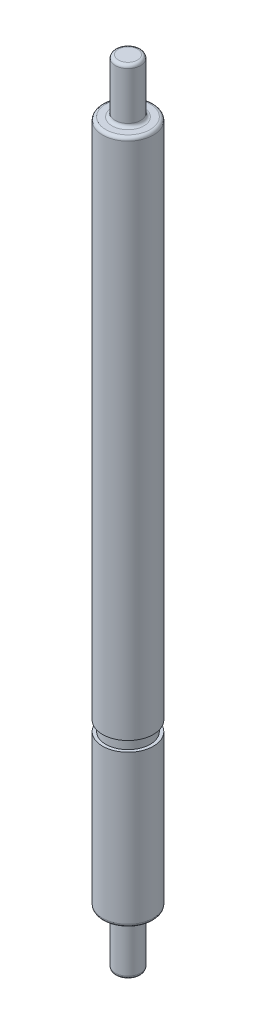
ISO-10303-21;
HEADER;
FILE_DESCRIPTION(('STEP AP214'),'2;1');
FILE_NAME('part.step','',(''),(''),'','','');
FILE_SCHEMA(('AUTOMOTIVE_DESIGN { 1 0 10303 214 1 1 1 1 }'));
ENDSEC;
DATA;
#1=APPLICATION_CONTEXT('core data for automotive mechanical design processes');
#2=APPLICATION_PROTOCOL_DEFINITION('international standard','automotive_design',2000,#1);
#3=PRODUCT_CONTEXT('',#1,'mechanical');
#4=PRODUCT('Part','Part','',(#3));
#5=PRODUCT_RELATED_PRODUCT_CATEGORY('part','',(#4));
#6=PRODUCT_DEFINITION_FORMATION('','',#4);
#7=PRODUCT_DEFINITION_CONTEXT('part definition',#1,'design');
#8=PRODUCT_DEFINITION('design','',#6,#7);
#9=PRODUCT_DEFINITION_SHAPE('','',#8);
#10=(LENGTH_UNIT() NAMED_UNIT(*) SI_UNIT(.MILLI.,.METRE.));
#11=(NAMED_UNIT(*) PLANE_ANGLE_UNIT() SI_UNIT($,.RADIAN.));
#12=(NAMED_UNIT(*) SI_UNIT($,.STERADIAN.) SOLID_ANGLE_UNIT());
#13=UNCERTAINTY_MEASURE_WITH_UNIT(LENGTH_MEASURE(1.E-05),#10,'distance_accuracy_value','');
#14=(GEOMETRIC_REPRESENTATION_CONTEXT(3) GLOBAL_UNCERTAINTY_ASSIGNED_CONTEXT((#13)) GLOBAL_UNIT_ASSIGNED_CONTEXT((#10,
#11,#12)) REPRESENTATION_CONTEXT('',''));
#15=CARTESIAN_POINT('',(0.,0.,0.));
#16=DIRECTION('',(0.,0.,1.));
#17=DIRECTION('',(1.,0.,0.));
#18=AXIS2_PLACEMENT_3D('',#15,#16,#17);
#19=CARTESIAN_POINT('',(0.,-31.25,0.));
#20=DIRECTION('',(0.,1.,0.));
#21=DIRECTION('',(0.,0.,1.));
#22=AXIS2_PLACEMENT_3D('',#19,#20,#21);
#23=PLANE('',#22);
#24=CARTESIAN_POINT('',(0.,-31.2499999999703,0.));
#25=DIRECTION('',(0.,1.,0.));
#26=DIRECTION('',(-1.,0.,0.));
#27=AXIS2_PLACEMENT_3D('',#24,#25,#26);
#28=CIRCLE('',#27,0.749996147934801);
#29=CARTESIAN_POINT('',(-0.74999691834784,-31.2499999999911,0.));
#30=VERTEX_POINT('',#29);
#31=CARTESIAN_POINT('',(0.74999691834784,-31.2499999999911,0.));
#32=VERTEX_POINT('',#31);
#33=EDGE_CURVE('E69',#30,#32,#28,.T.);
#34=ORIENTED_EDGE('',*,*,#33,.F.);
#35=CARTESIAN_POINT('',(0.,-31.2499999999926,0.));
#36=DIRECTION('',(0.,1.,0.));
#37=DIRECTION('',(1.,0.,0.));
#38=AXIS2_PLACEMENT_3D('',#35,#36,#37);
#39=CIRCLE('',#38,0.7499980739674);
#40=EDGE_CURVE('E73',#32,#30,#39,.T.);
#41=ORIENTED_EDGE('',*,*,#40,.F.);
#42=EDGE_LOOP('',(#34,#41));
#43=FACE_BOUND('',#42,.T.);
#44=ADVANCED_FACE('F17',(#43),#23,.F.);
#45=CARTESIAN_POINT('',(0.,-31.,0.));
#46=DIRECTION('',(0.,1.,0.));
#47=DIRECTION('',(-0.990619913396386,0.,0.136646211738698));
#48=AXIS2_PLACEMENT_3D('',#45,#46,#47);
#49=TOROIDAL_SURFACE('',#48,0.75,0.25);
#50=CARTESIAN_POINT('',(0.,-31.,0.));
#51=DIRECTION('',(0.,1.,0.));
#52=DIRECTION('',(0.,0.,1.));
#53=AXIS2_PLACEMENT_3D('',#50,#51,#52);
#54=CIRCLE('',#53,1.);
#55=CARTESIAN_POINT('',(0.,-31.,1.));
#56=VERTEX_POINT('',#55);
#57=EDGE_CURVE('E79',#56,#56,#54,.T.);
#58=ORIENTED_EDGE('',*,*,#57,.F.);
#59=EDGE_LOOP('',(#58));
#60=FACE_BOUND('',#59,.T.);
#61=ORIENTED_EDGE('',*,*,#40,.T.);
#62=ORIENTED_EDGE('',*,*,#33,.T.);
#63=EDGE_LOOP('',(#61,#62));
#64=FACE_BOUND('',#63,.T.);
#65=ADVANCED_FACE('F78',(#60,#64),#49,.T.);
#66=CARTESIAN_POINT('',(0.,-27.,0.));
#67=DIRECTION('',(0.,1.,0.));
#68=DIRECTION('',(0.,0.,1.));
#69=AXIS2_PLACEMENT_3D('',#66,#67,#68);
#70=CYLINDRICAL_SURFACE('',#69,1.);
#71=CARTESIAN_POINT('',(0.,-27.25,0.));
#72=DIRECTION('',(0.,1.,0.));
#73=DIRECTION('',(-0.990619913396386,0.,0.136646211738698));
#74=AXIS2_PLACEMENT_3D('',#71,#72,#73);
#75=CIRCLE('',#74,1.);
#76=CARTESIAN_POINT('',(-0.990619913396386,-27.25,0.136646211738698));
#77=VERTEX_POINT('',#76);
#78=EDGE_CURVE('E102',#77,#77,#75,.F.);
#79=ORIENTED_EDGE('',*,*,#78,.T.);
#80=EDGE_LOOP('',(#79));
#81=FACE_BOUND('',#80,.T.);
#82=ORIENTED_EDGE('',*,*,#57,.T.);
#83=EDGE_LOOP('',(#82));
#84=FACE_BOUND('',#83,.T.);
#85=ADVANCED_FACE('F96',(#81,#84),#70,.T.);
#86=CARTESIAN_POINT('',(0.,-27.25,0.));
#87=DIRECTION('',(0.,1.,0.));
#88=DIRECTION('',(-0.990619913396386,0.,0.136646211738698));
#89=AXIS2_PLACEMENT_3D('',#86,#87,#88);
#90=TOROIDAL_SURFACE('',#89,1.25,0.25);
#91=ORIENTED_EDGE('',*,*,#78,.F.);
#92=EDGE_LOOP('',(#91));
#93=FACE_BOUND('',#92,.T.);
#94=CARTESIAN_POINT('',(1.249993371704,-27.0000000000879,0.));
#95=CARTESIAN_POINT('',(1.24997944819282,-27.0000000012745,0.0174478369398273));
#96=CARTESIAN_POINT('',(1.24960325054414,-27.0000000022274,0.0348950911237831));
#97=CARTESIAN_POINT('',(1.24812975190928,-27.0000000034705,0.0697587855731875));
#98=CARTESIAN_POINT('',(1.24703246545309,-27.0000000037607,0.0871752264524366));
#99=CARTESIAN_POINT('',(1.24412023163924,-27.0000000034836,0.121948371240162));
#100=CARTESIAN_POINT('',(1.24230528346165,-27.0000000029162,0.139305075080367));
#101=CARTESIAN_POINT('',(1.23795177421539,-26.99999999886,0.173926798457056));
#102=CARTESIAN_POINT('',(1.23541319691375,-26.9999999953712,0.191191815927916));
#103=CARTESIAN_POINT('',(1.22923970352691,-27.000000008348,0.228069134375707));
#104=CARTESIAN_POINT('',(1.22549996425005,-27.0000000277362,0.247664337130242));
#105=CARTESIAN_POINT('',(1.22012049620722,-27.000000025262,0.272241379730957));
#106=CARTESIAN_POINT('',(1.21896863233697,-27.000000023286,0.277331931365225));
#107=CARTESIAN_POINT('',(1.21362493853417,-27.0000000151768,0.300285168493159));
#108=CARTESIAN_POINT('',(1.2090744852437,-27.0000000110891,0.318065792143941));
#109=CARTESIAN_POINT('',(1.19842658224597,-27.0000000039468,0.356144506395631));
#110=CARTESIAN_POINT('',(1.19219870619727,-27.0000000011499,0.37640635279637));
#111=CARTESIAN_POINT('',(1.18385304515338,-27.0000000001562,0.401299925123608));
#112=CARTESIAN_POINT('',(1.18221311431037,-27.0000000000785,0.406095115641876));
#113=CARTESIAN_POINT('',(1.17460167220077,-26.999999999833,0.427927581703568));
#114=CARTESIAN_POINT('',(1.16829804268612,-26.9999999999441,0.444850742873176));
#115=CARTESIAN_POINT('',(1.15479575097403,-27.0000000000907,0.478872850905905));
#116=CARTESIAN_POINT('',(1.14757733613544,-27.0000000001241,0.495963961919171));
#117=CARTESIAN_POINT('',(1.13778662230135,-27.0000000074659,0.517807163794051));
#118=CARTESIAN_POINT('',(1.13555086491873,-27.0000000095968,0.522711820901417));
#119=CARTESIAN_POINT('',(1.12760780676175,-27.0000000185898,0.539841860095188));
#120=CARTESIAN_POINT('',(1.12173349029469,-27.0000000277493,0.551990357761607));
#121=CARTESIAN_POINT('',(1.10716080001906,-27.0000000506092,0.580908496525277));
#122=CARTESIAN_POINT('',(1.09827270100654,-27.0000000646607,0.597582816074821));
#123=CARTESIAN_POINT('',(1.07974270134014,-27.0000000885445,0.630507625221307));
#124=CARTESIAN_POINT('',(1.07010077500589,-27.0000000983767,0.646758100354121));
#125=CARTESIAN_POINT('',(1.05008263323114,-27.000000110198,0.67880065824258));
#126=CARTESIAN_POINT('',(1.03970640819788,-27.0000001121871,0.694592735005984));
#127=CARTESIAN_POINT('',(1.01824252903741,-27.0000001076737,0.725685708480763));
#128=CARTESIAN_POINT('',(1.00715488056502,-27.0000001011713,0.740986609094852));
#129=CARTESIAN_POINT('',(0.984288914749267,-27.000000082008,0.771062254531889));
#130=CARTESIAN_POINT('',(0.972510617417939,-27.0000000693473,0.785837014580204));
#131=CARTESIAN_POINT('',(0.948298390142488,-27.0000000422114,0.814838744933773));
#132=CARTESIAN_POINT('',(0.935864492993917,-27.0000000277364,0.829065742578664));
#133=CARTESIAN_POINT('',(0.910330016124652,-27.0000000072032,0.856905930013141));
#134=CARTESIAN_POINT('',(0.897229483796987,-27.0000000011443,0.8705191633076));
#135=CARTESIAN_POINT('',(0.878509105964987,-26.999999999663,0.889252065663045));
#136=CARTESIAN_POINT('',(0.873098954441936,-27.0000000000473,0.894584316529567));
#137=CARTESIAN_POINT('',(0.851782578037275,-27.0000000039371,0.91520655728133));
#138=CARTESIAN_POINT('',(0.835509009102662,-27.000000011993,0.930121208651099));
#139=CARTESIAN_POINT('',(0.804435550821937,-27.000000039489,0.957132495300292));
#140=CARTESIAN_POINT('',(0.789730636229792,-27.000000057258,0.969338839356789));
#141=CARTESIAN_POINT('',(0.768122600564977,-27.0000000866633,0.986448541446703));
#142=CARTESIAN_POINT('',(0.761438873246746,-27.0000000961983,0.991630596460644));
#143=CARTESIAN_POINT('',(0.739483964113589,-27.0000001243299,1.00829263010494));
#144=CARTESIAN_POINT('',(0.723995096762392,-27.0000001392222,1.01948798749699));
#145=CARTESIAN_POINT('',(0.691148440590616,-27.0000001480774,1.04207739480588));
#146=CARTESIAN_POINT('',(0.673744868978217,-27.0000001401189,1.05340489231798));
#147=CARTESIAN_POINT('',(0.643872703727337,-27.0000001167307,1.07179157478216));
#148=CARTESIAN_POINT('',(0.631547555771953,-27.0000001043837,1.07908498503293));
#149=CARTESIAN_POINT('',(0.607658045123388,-27.0000000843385,1.09267537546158));
#150=CARTESIAN_POINT('',(0.59611241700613,-27.000000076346,1.09900528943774));
#151=CARTESIAN_POINT('',(0.572176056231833,-27.0000000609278,1.11164059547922));
#152=CARTESIAN_POINT('',(0.559774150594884,-27.0000000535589,1.11792485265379));
#153=CARTESIAN_POINT('',(0.536180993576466,-27.0000000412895,1.12939015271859));
#154=CARTESIAN_POINT('',(0.525011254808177,-27.0000000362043,1.13461562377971));
#155=CARTESIAN_POINT('',(0.495573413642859,-27.0000000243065,1.14786000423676));
#156=CARTESIAN_POINT('',(0.477183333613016,-27.000000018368,1.15561017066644));
#157=CARTESIAN_POINT('',(0.445901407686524,-27.0000000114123,1.16792520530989));
#158=CARTESIAN_POINT('',(0.433101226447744,-27.0000000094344,1.17272475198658));
#159=CARTESIAN_POINT('',(0.413266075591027,-27.0000000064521,1.17979148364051));
#160=CARTESIAN_POINT('',(0.406284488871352,-27.0000000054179,1.18220895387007));
#161=CARTESIAN_POINT('',(0.398377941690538,-27.0000000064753,1.18487897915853));
#162=CARTESIAN_POINT('',(0.397470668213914,-27.0000000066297,1.18518435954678));
#163=CARTESIAN_POINT('',(0.384754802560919,-27.0000000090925,1.18944895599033));
#164=CARTESIAN_POINT('',(0.372889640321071,-27.0000000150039,1.19324160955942));
#165=CARTESIAN_POINT('',(0.344280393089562,-27.0000000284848,1.20190699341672));
#166=CARTESIAN_POINT('',(0.327483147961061,-27.000000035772,1.20660493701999));
#167=CARTESIAN_POINT('',(0.29370581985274,-27.0000000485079,1.21529016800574));
#168=CARTESIAN_POINT('',(0.276725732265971,-27.0000000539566,1.21927743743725));
#169=CARTESIAN_POINT('',(0.242611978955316,-27.0000000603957,1.22653107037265));
#170=CARTESIAN_POINT('',(0.225478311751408,-27.000000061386,1.22979742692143));
#171=CARTESIAN_POINT('',(0.19108854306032,-27.0000000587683,1.23560423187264));
#172=CARTESIAN_POINT('',(0.173832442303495,-27.0000000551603,1.23814468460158));
#173=CARTESIAN_POINT('',(0.139228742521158,-27.0000000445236,1.24249463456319));
#174=CARTESIAN_POINT('',(0.121881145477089,-27.000000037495,1.24430414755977));
#175=CARTESIAN_POINT('',(0.0871256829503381,-27.000000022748,1.24719006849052));
#176=CARTESIAN_POINT('',(0.0697178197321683,-27.0000000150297,1.24826650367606));
#177=CARTESIAN_POINT('',(0.0348730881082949,-27.0000000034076,1.24968058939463));
#178=CARTESIAN_POINT('',(0.0174362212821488,-26.9999999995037,1.25001827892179));
#179=CARTESIAN_POINT('',(-0.01742195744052,-27.0000000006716,1.24996848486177));
#180=CARTESIAN_POINT('',(-0.0348432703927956,-27.0000000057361,1.24958159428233));
#181=CARTESIAN_POINT('',(-0.0696547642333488,-27.0000000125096,1.24809828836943));
#182=CARTESIAN_POINT('',(-0.0870449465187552,-27.0000000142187,1.24700190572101));
#183=CARTESIAN_POINT('',(-0.121765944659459,-27.0000000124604,1.24409852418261));
#184=CARTESIAN_POINT('',(-0.139096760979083,-27.0000000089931,1.24229153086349));
#185=CARTESIAN_POINT('',(-0.173669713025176,-27.000000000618,1.23796792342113));
#186=CARTESIAN_POINT('',(-0.19091184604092,-26.9999999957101,1.23545128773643));
#187=CARTESIAN_POINT('',(-0.22773775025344,-27.0000000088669,1.22931426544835));
#188=CARTESIAN_POINT('',(-0.247304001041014,-27.0000000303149,1.22558753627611));
#189=CARTESIAN_POINT('',(-0.281374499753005,-27.0000000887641,1.21823107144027));
#190=CARTESIAN_POINT('',(-0.295923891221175,-27.0000001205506,1.21480905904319));
#191=CARTESIAN_POINT('',(-0.327291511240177,-27.0000001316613,1.20678583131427));
#192=CARTESIAN_POINT('',(-0.344084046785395,-27.0000001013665,1.20208314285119));
#193=CARTESIAN_POINT('',(-0.372667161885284,-27.0000000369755,1.193363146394));
#194=CARTESIAN_POINT('',(-0.384515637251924,-27.0000000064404,1.18953408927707));
#195=CARTESIAN_POINT('',(-0.398431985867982,-27.0000000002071,1.18481813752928));
#196=CARTESIAN_POINT('',(-0.400555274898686,-27.0000000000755,1.18409255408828));
#197=CARTESIAN_POINT('',(-0.41567367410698,-26.9999999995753,1.17889162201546));
#198=CARTESIAN_POINT('',(-0.428614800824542,-27.000000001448,1.17425749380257));
#199=CARTESIAN_POINT('',(-0.462915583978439,-27.0000000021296,1.16133634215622));
#200=CARTESIAN_POINT('',(-0.484136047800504,-26.999999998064,1.15267364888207));
#201=CARTESIAN_POINT('',(-0.512636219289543,-27.000000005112,1.14013236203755));
#202=CARTESIAN_POINT('',(-0.520136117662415,-27.0000000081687,1.13674494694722));
#203=CARTESIAN_POINT('',(-0.539842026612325,-27.0000000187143,1.12760814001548));
#204=CARTESIAN_POINT('',(-0.551990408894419,-27.0000000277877,1.12173359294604));
#205=CARTESIAN_POINT('',(-0.580908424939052,-27.0000000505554,1.10716065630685));
#206=CARTESIAN_POINT('',(-0.597582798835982,-27.0000000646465,1.09827266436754));
#207=CARTESIAN_POINT('',(-0.630507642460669,-27.0000000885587,1.07974273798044));
#208=CARTESIAN_POINT('',(-0.646758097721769,-27.0000000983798,1.07010077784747));
#209=CARTESIAN_POINT('',(-0.678800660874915,-27.0000001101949,1.05008263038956));
#210=CARTESIAN_POINT('',(-0.694592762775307,-27.0000001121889,1.03970643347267));
#211=CARTESIAN_POINT('',(-0.72568568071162,-27.0000001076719,1.01824250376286));
#212=CARTESIAN_POINT('',(-0.740986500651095,-27.0000001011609,1.00715477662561));
#213=CARTESIAN_POINT('',(-0.771062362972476,-27.0000000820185,0.984289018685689));
#214=CARTESIAN_POINT('',(-0.785837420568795,-27.0000000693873,0.972511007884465));
#215=CARTESIAN_POINT('',(-0.814838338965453,-27.0000000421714,0.948297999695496));
#216=CARTESIAN_POINT('',(-0.829064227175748,-27.0000000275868,0.93586303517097));
#217=CARTESIAN_POINT('',(-0.856907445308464,-27.0000000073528,0.910331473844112));
#218=CARTESIAN_POINT('',(-0.870524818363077,-27.0000000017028,0.897234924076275));
#219=CARTESIAN_POINT('',(-0.890672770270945,-26.9999999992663,0.877083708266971));
#220=CARTESIAN_POINT('',(-0.89739857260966,-26.9999999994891,0.870221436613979));
#221=CARTESIAN_POINT('',(-0.926936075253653,-27.0000000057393,0.839381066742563));
#222=CARTESIAN_POINT('',(-0.948888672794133,-27.0000000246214,0.81456009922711));
#223=CARTESIAN_POINT('',(-0.979463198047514,-27.0000000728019,0.777087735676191));
#224=CARTESIAN_POINT('',(-0.988895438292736,-27.0000000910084,0.765084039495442));
#225=CARTESIAN_POINT('',(-1.00928448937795,-27.0000001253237,0.738117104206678));
#226=CARTESIAN_POINT('',(-1.0201338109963,-27.0000001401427,0.723071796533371));
#227=CARTESIAN_POINT('',(-1.03544565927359,-27.0000001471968,0.700787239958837));
#228=CARTESIAN_POINT('',(-1.04018364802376,-27.0000001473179,0.693735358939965));
#229=CARTESIAN_POINT('',(-1.05004580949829,-27.0000001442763,0.678723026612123));
#230=CARTESIAN_POINT('',(-1.05515219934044,-27.0000001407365,0.670750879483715));
#231=CARTESIAN_POINT('',(-1.07019549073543,-27.0000001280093,0.64666297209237));
#232=CARTESIAN_POINT('',(-1.0798574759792,-27.0000001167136,0.630374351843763));
#233=CARTESIAN_POINT('',(-1.09842370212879,-27.0000000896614,0.597372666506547));
#234=CARTESIAN_POINT('',(-1.10732797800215,-27.0000000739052,0.580659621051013));
#235=CARTESIAN_POINT('',(-1.12436307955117,-27.0000000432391,0.546844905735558));
#236=CARTESIAN_POINT('',(-1.13249395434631,-27.000000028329,0.52974326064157));
#237=CARTESIAN_POINT('',(-1.14795677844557,-27.0000000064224,0.495184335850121));
#238=CARTESIAN_POINT('',(-1.1552887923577,-26.9999999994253,0.47772708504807));
#239=CARTESIAN_POINT('',(-1.16863230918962,-27.0000000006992,0.443868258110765));
#240=CARTESIAN_POINT('',(-1.17470209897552,-27.0000000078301,0.427489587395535));
#241=CARTESIAN_POINT('',(-1.18618276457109,-27.0000000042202,0.394504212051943));
#242=CARTESIAN_POINT('',(-1.19159367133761,-26.9999999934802,0.377897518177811));
#243=CARTESIAN_POINT('',(-1.20111586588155,-27.0000000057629,0.346646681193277));
#244=CARTESIAN_POINT('',(-1.20530473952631,-27.0000000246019,0.332026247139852));
#245=CARTESIAN_POINT('',(-1.2122511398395,-27.0000000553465,0.305814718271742));
#246=CARTESIAN_POINT('',(-1.21512213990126,-27.0000000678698,0.294253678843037));
#247=CARTESIAN_POINT('',(-1.22209376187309,-27.0000000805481,0.264269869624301));
#248=CARTESIAN_POINT('',(-1.22593234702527,-27.0000000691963,0.245785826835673));
#249=CARTESIAN_POINT('',(-1.23279477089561,-27.0000000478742,0.208495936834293));
#250=CARTESIAN_POINT('',(-1.23581102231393,-27.000000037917,0.189688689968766));
#251=CARTESIAN_POINT('',(-1.23938813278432,-27.0000000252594,0.163560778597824));
#252=CARTESIAN_POINT('',(-1.24031827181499,-27.000000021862,0.156288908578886));
#253=CARTESIAN_POINT('',(-1.24399836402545,-27.0000000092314,0.125365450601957));
#254=CARTESIAN_POINT('',(-1.24613933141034,-27.0000000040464,0.10163699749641));
#255=CARTESIAN_POINT('',(-1.24862136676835,-27.0000000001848,0.0613051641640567));
#256=CARTESIAN_POINT('',(-1.24931127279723,-27.000000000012,0.0447217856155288));
#257=CARTESIAN_POINT('',(-1.24988612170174,-27.0000000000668,0.0187558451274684));
#258=CARTESIAN_POINT('',(-1.24999064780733,-27.0000000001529,0.00937792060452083));
#259=CARTESIAN_POINT('',(-1.249993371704,-27.0000000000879,0.));
#260=B_SPLINE_CURVE_WITH_KNOTS('',3,(#94,#95,#96,#97,#98,#99,#100,#101,#102,#103,#104,#105,#106,
#107,#108,#109,#110,#111,#112,#113,#114,#115,#116,#117,#118,#119,#120,#121,#122,#123,#124,#125,
#126,#127,#128,#129,#130,#131,#132,#133,#134,#135,#136,#137,#138,#139,#140,#141,#142,#143,#144,
#145,#146,#147,#148,#149,#150,#151,#152,#153,#154,#155,#156,#157,#158,#159,#160,#161,#162,#163,
#164,#165,#166,#167,#168,#169,#170,#171,#172,#173,#174,#175,#176,#177,#178,#179,#180,#181,#182,
#183,#184,#185,#186,#187,#188,#189,#190,#191,#192,#193,#194,#195,#196,#197,#198,#199,#200,#201,
#202,#203,#204,#205,#206,#207,#208,#209,#210,#211,#212,#213,#214,#215,#216,#217,#218,#219,#220,
#221,#222,#223,#224,#225,#226,#227,#228,#229,#230,#231,#232,#233,#234,#235,#236,#237,#238,#239,
#240,#241,#242,#243,#244,#245,#246,#247,#248,#249,#250,#251,#252,#253,#254,#255,#256,#257,#258,
#259),.UNSPECIFIED.,.F.,.F.,(4,2,2,2,2,2,2,2,2,2,2,2,2,2,2,2,2,2,2,2,2,2,2,2,2,2,2,2,2,2,2,2,2,
2,2,2,2,2,2,2,2,2,2,2,2,2,2,2,2,2,2,2,2,2,2,2,2,2,2,2,2,2,2,2,2,2,2,2,2,2,2,2,2,2,2,2,2,2,2,2,2,
2,4),(0.,0.0523392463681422,0.104677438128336,0.157015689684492,0.209355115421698,
0.269173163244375,0.284830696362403,0.339873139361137,0.403433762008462,0.418637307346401,
0.472796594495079,0.528436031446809,0.544606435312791,0.58508154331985,0.641746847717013,
0.698414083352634,0.755082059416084,0.811749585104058,0.868415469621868,0.925078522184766,
0.981737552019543,1.00452595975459,1.07071299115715,1.12802547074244,1.15339615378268,
1.21070751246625,1.27297540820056,1.31593169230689,1.35542621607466,1.39712763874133,
1.43411793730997,1.49396172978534,1.53496601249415,1.55712975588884,1.56000162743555,
1.59736548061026,1.64967473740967,1.70198531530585,1.75429639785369,1.80660716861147,
1.85891681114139,1.91122450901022,1.96352944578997,2.01579159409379,2.06805133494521,
2.12031066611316,2.17257158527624,2.23230158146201,2.27713120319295,2.32942691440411,
2.36677626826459,2.37350781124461,2.41474009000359,2.48346024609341,2.50814763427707,
2.54862274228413,2.6052880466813,2.66195528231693,2.71862325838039,2.77529078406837,
2.83195666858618,2.88861972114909,2.94527875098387,2.97410465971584,3.0733792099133,
3.11917142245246,3.17479567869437,3.20028152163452,3.22868128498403,3.28547573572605,
3.34226756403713,3.39905578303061,3.45583940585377,3.50822685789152,3.56061184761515,
3.60622732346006,3.64195856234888,3.69857305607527,3.75569347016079,3.77768643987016,
3.84911463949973,3.89889602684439,3.92702938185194),.UNSPECIFIED.);
#261=CARTESIAN_POINT('',(1.2499953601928,-27.0000000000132,0.));
#262=VERTEX_POINT('',#261);
#263=CARTESIAN_POINT('',(-1.2499953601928,-27.0000000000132,0.));
#264=VERTEX_POINT('',#263);
#265=EDGE_CURVE('E108',#262,#264,#260,.T.);
#266=ORIENTED_EDGE('',*,*,#265,.T.);
#267=CARTESIAN_POINT('',(0.,-27.000000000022,0.));
#268=DIRECTION('',(0.,-1.,0.));
#269=DIRECTION('',(-1.,0.,0.));
#270=AXIS2_PLACEMENT_3D('',#267,#268,#269);
#271=CIRCLE('',#270,1.249996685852);
#272=EDGE_CURVE('E111',#264,#262,#271,.T.);
#273=ORIENTED_EDGE('',*,*,#272,.T.);
#274=EDGE_LOOP('',(#266,#273));
#275=FACE_BOUND('',#274,.T.);
#276=ADVANCED_FACE('F343',(#93,#275),#90,.F.);
#277=CARTESIAN_POINT('',(0.,31.25,0.));
#278=DIRECTION('',(0.,1.,0.));
#279=DIRECTION('',(0.,0.,1.));
#280=AXIS2_PLACEMENT_3D('',#277,#278,#279);
#281=PLANE('',#280);
#282=CARTESIAN_POINT('',(0.,31.2499999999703,0.));
#283=DIRECTION('',(0.,-1.,0.));
#284=DIRECTION('',(1.,0.,0.));
#285=AXIS2_PLACEMENT_3D('',#282,#283,#284);
#286=CIRCLE('',#285,0.7499961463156);
#287=CARTESIAN_POINT('',(0.74999691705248,31.2499999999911,0.));
#288=VERTEX_POINT('',#287);
#289=CARTESIAN_POINT('',(-0.74999691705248,31.2499999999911,0.));
#290=VERTEX_POINT('',#289);
#291=EDGE_CURVE('E116',#288,#290,#286,.T.);
#292=ORIENTED_EDGE('',*,*,#291,.F.);
#293=CARTESIAN_POINT('',(0.,31.2499999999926,0.));
#294=DIRECTION('',(0.,-1.,0.));
#295=DIRECTION('',(-1.,0.,0.));
#296=AXIS2_PLACEMENT_3D('',#293,#294,#295);
#297=CIRCLE('',#296,0.7499980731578);
#298=EDGE_CURVE('E118',#290,#288,#297,.T.);
#299=ORIENTED_EDGE('',*,*,#298,.F.);
#300=EDGE_LOOP('',(#292,#299));
#301=FACE_BOUND('',#300,.T.);
#302=ADVANCED_FACE('F162',(#301),#281,.T.);
#303=CARTESIAN_POINT('',(0.,-27.,0.));
#304=DIRECTION('',(0.,1.,0.));
#305=DIRECTION('',(0.,0.,1.));
#306=AXIS2_PLACEMENT_3D('',#303,#304,#305);
#307=PLANE('',#306);
#308=ORIENTED_EDGE('',*,*,#265,.F.);
#309=ORIENTED_EDGE('',*,*,#272,.F.);
#310=EDGE_LOOP('',(#308,#309));
#311=FACE_BOUND('',#310,.T.);
#312=CARTESIAN_POINT('',(-1.749997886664,-26.9999999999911,0.));
#313=CARTESIAN_POINT('',(-1.74998264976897,-26.9999999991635,0.0257197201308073));
#314=CARTESIAN_POINT('',(-1.74942271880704,-27.0000000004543,0.0514381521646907));
#315=CARTESIAN_POINT('',(-1.74768663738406,-26.9999999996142,0.0913799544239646));
#316=CARTESIAN_POINT('',(-1.74689608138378,-26.9999999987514,0.105620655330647));
#317=CARTESIAN_POINT('',(-1.74488779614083,-26.9999999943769,0.135267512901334));
#318=CARTESIAN_POINT('',(-1.74363989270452,-26.9999999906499,0.150671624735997));
#319=CARTESIAN_POINT('',(-1.73956745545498,-26.9999999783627,0.193792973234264));
#320=CARTESIAN_POINT('',(-1.73628144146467,-26.9999999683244,0.221468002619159));
#321=CARTESIAN_POINT('',(-1.72838666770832,-26.9999999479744,0.276628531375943));
#322=CARTESIAN_POINT('',(-1.72377786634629,-26.9999999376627,0.3041140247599));
#323=CARTESIAN_POINT('',(-1.71324729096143,-26.9999999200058,0.358833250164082));
#324=CARTESIAN_POINT('',(-1.70732548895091,-26.9999999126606,0.386066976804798));
#325=CARTESIAN_POINT('',(-1.69418276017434,-26.9999999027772,0.440219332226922));
#326=CARTESIAN_POINT('',(-1.68696181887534,-26.9999999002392,0.467137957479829));
#327=CARTESIAN_POINT('',(-1.67123737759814,-26.9999999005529,0.52059816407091));
#328=CARTESIAN_POINT('',(-1.66273387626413,-26.9999999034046,0.547139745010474));
#329=CARTESIAN_POINT('',(-1.64446410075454,-26.9999999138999,0.599783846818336));
#330=CARTESIAN_POINT('',(-1.63469783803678,-26.9999999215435,0.625886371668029));
#331=CARTESIAN_POINT('',(-1.61392466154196,-26.999999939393,0.677594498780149));
#332=CARTESIAN_POINT('',(-1.60291777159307,-26.9999999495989,0.703200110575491));
#333=CARTESIAN_POINT('',(-1.58823020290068,-26.9999999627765,0.735225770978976));
#334=CARTESIAN_POINT('',(-1.58511390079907,-26.9999999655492,0.741908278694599));
#335=CARTESIAN_POINT('',(-1.57262119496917,-26.9999999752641,0.768264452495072));
#336=CARTESIAN_POINT('',(-1.5629210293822,-26.9999999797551,0.787785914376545));
#337=CARTESIAN_POINT('',(-1.53918917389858,-26.999999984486,0.833416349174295));
#338=CARTESIAN_POINT('',(-1.52485474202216,-26.999999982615,0.859368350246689));
#339=CARTESIAN_POINT('',(-1.49490024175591,-26.9999999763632,0.910517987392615));
#340=CARTESIAN_POINT('',(-1.47928016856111,-26.9999999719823,0.935715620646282));
#341=CARTESIAN_POINT('',(-1.44397104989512,-26.9999999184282,0.989625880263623));
#342=CARTESIAN_POINT('',(-1.42404735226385,-26.99999986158,1.01818556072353));
#343=CARTESIAN_POINT('',(-1.38860214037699,-26.999999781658,1.06586621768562));
#344=CARTESIAN_POINT('',(-1.37350108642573,-26.9999997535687,1.08530104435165));
#345=CARTESIAN_POINT('',(-1.33668815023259,-26.9999998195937,1.13043704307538));
#346=CARTESIAN_POINT('',(-1.31458411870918,-26.9999999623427,1.15582016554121));
#347=CARTESIAN_POINT('',(-1.28019451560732,-27.0000000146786,1.19326823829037));
#348=CARTESIAN_POINT('',(-1.26838750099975,-27.0000000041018,1.20578174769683));
#349=CARTESIAN_POINT('',(-1.22747721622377,-26.9999999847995,1.24795243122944));
#350=CARTESIAN_POINT('',(-1.197538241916,-26.9999999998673,1.27681507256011));
#351=CARTESIAN_POINT('',(-1.14648536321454,-26.9999999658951,1.32261361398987));
#352=CARTESIAN_POINT('',(-1.1259430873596,-26.9999999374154,1.34019305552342));
#353=CARTESIAN_POINT('',(-1.08213728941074,-26.9999998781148,1.37594263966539));
#354=CARTESIAN_POINT('',(-1.05879699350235,-26.9999998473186,1.3940190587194));
#355=CARTESIAN_POINT('',(-1.01122494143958,-26.9999997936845,1.42895874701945));
#356=CARTESIAN_POINT('',(-0.986993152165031,-26.999999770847,1.44582197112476));
#357=CARTESIAN_POINT('',(-0.937700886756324,-26.9999997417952,1.47829158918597));
#358=CARTESIAN_POINT('',(-0.912640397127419,-26.9999997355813,1.49389796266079));
#359=CARTESIAN_POINT('',(-0.861756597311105,-26.999999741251,1.52381291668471));
#360=CARTESIAN_POINT('',(-0.835933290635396,-26.9999997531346,1.53812150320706));
#361=CARTESIAN_POINT('',(-0.783591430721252,-26.9999997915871,1.56540283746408));
#362=CARTESIAN_POINT('',(-0.757072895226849,-26.9999998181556,1.57837561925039));
#363=CARTESIAN_POINT('',(-0.703410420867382,-26.999999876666,1.60295363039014));
#364=CARTESIAN_POINT('',(-0.676266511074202,-26.9999999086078,1.61455892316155));
#365=CARTESIAN_POINT('',(-0.624073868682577,-26.9999999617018,1.63530957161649));
#366=CARTESIAN_POINT('',(-0.599076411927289,-26.9999999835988,1.64458428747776));
#367=CARTESIAN_POINT('',(-0.545490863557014,-27.0000000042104,1.66309668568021));
#368=CARTESIAN_POINT('',(-0.516849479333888,-26.9999999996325,1.67218047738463));
#369=CARTESIAN_POINT('',(-0.461694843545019,-26.9999999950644,1.68816873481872));
#370=CARTESIAN_POINT('',(-0.43521667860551,-26.9999999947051,1.69519474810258));
#371=CARTESIAN_POINT('',(-0.3819641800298,-27.000000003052,1.70802195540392));
#372=CARTESIAN_POINT('',(-0.355189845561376,-27.0000000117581,1.71382314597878));
#373=CARTESIAN_POINT('',(-0.306436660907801,-26.999999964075,1.72323897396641));
#374=CARTESIAN_POINT('',(-0.284497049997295,-26.9999999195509,1.72705963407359));
#375=CARTESIAN_POINT('',(-0.230276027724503,-26.9999998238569,1.73541042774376));
#376=CARTESIAN_POINT('',(-0.197915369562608,-26.9999997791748,1.73944836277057));
#377=CARTESIAN_POINT('',(-0.144475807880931,-26.9999998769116,1.7443838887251));
#378=CARTESIAN_POINT('',(-0.123450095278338,-26.9999999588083,1.74588693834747));
#379=CARTESIAN_POINT('',(-0.076300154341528,-27.0000000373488,1.74850768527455));
#380=CARTESIAN_POINT('',(-0.0501659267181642,-27.0000000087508,1.74944575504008));
#381=CARTESIAN_POINT('',(0.00399614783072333,-26.9999999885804,1.75020640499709));
#382=CARTESIAN_POINT('',(0.032025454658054,-26.999999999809,1.74994420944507));
#383=CARTESIAN_POINT('',(0.0676925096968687,-26.9999999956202,1.74875672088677));
#384=CARTESIAN_POINT('',(0.0753544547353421,-26.9999999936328,1.74845136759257));
#385=CARTESIAN_POINT('',(0.110631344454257,-26.9999999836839,1.74681151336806));
#386=CARTESIAN_POINT('',(0.138221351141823,-26.9999999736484,1.7448684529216));
#387=CARTESIAN_POINT('',(0.193276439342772,-26.9999999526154,1.73967026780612));
#388=CARTESIAN_POINT('',(0.220741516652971,-26.9999999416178,1.73641509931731));
#389=CARTESIAN_POINT('',(0.275486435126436,-26.9999999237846,1.72859948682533));
#390=CARTESIAN_POINT('',(0.302766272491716,-26.9999999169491,1.72403901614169));
#391=CARTESIAN_POINT('',(0.357077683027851,-26.9999999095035,1.71362330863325));
#392=CARTESIAN_POINT('',(0.384109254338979,-26.9999999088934,1.70776806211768));
#393=CARTESIAN_POINT('',(0.437862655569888,-26.9999999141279,1.69477615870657));
#394=CARTESIAN_POINT('',(0.464584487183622,-26.9999999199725,1.68763950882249));
#395=CARTESIAN_POINT('',(0.517656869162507,-26.9999999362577,1.67210099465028));
#396=CARTESIAN_POINT('',(0.54400742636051,-26.9999999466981,1.66369915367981));
#397=CARTESIAN_POINT('',(0.596278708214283,-26.9999999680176,1.6456500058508));
#398=CARTESIAN_POINT('',(0.622199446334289,-26.9999999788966,1.63600273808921));
#399=CARTESIAN_POINT('',(0.661788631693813,-26.9999999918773,1.62018153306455));
#400=CARTESIAN_POINT('',(0.675631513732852,-26.999999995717,1.61444040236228));
#401=CARTESIAN_POINT('',(0.701894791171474,-26.999999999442,1.60315351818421));
#402=CARTESIAN_POINT('',(0.714328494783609,-26.9999999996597,1.59763868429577));
#403=CARTESIAN_POINT('',(0.753702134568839,-27.0000000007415,1.57963451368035));
#404=CARTESIAN_POINT('',(0.780400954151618,-27.0000000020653,1.56661276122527));
#405=CARTESIAN_POINT('',(0.833117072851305,-26.9999999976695,1.53925999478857));
#406=CARTESIAN_POINT('',(0.859134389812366,-26.9999999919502,1.52492901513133));
#407=CARTESIAN_POINT('',(0.910412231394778,-26.9999999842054,1.49496927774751));
#408=CARTESIAN_POINT('',(0.935672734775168,-26.9999999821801,1.47934048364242));
#409=CARTESIAN_POINT('',(0.971786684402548,-26.9999998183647,1.45580249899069));
#410=CARTESIAN_POINT('',(0.982945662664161,-26.9999997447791,1.44835898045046));
#411=CARTESIAN_POINT('',(0.998988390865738,-26.9999997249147,1.43730979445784));
#412=CARTESIAN_POINT('',(1.00396207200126,-26.999999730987,1.43383471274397));
#413=CARTESIAN_POINT('',(1.03469132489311,-26.999999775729,1.41211887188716));
#414=CARTESIAN_POINT('',(1.05996365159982,-26.999999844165,1.39318431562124));
#415=CARTESIAN_POINT('',(1.10069095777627,-26.9999999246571,1.36091464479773));
#416=CARTESIAN_POINT('',(1.11645674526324,-26.9999999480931,1.34796771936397));
#417=CARTESIAN_POINT('',(1.14769275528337,-26.9999999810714,1.32139365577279));
#418=CARTESIAN_POINT('',(1.16315809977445,-26.9999999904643,1.3077607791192));
#419=CARTESIAN_POINT('',(1.19997667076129,-27.0000000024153,1.27415140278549));
#420=CARTESIAN_POINT('',(1.2210866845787,-27.0000000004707,1.25390682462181));
#421=CARTESIAN_POINT('',(1.24794640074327,-26.999999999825,1.2268783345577));
#422=CARTESIAN_POINT('',(1.25415195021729,-26.9999999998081,1.22054193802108));
#423=CARTESIAN_POINT('',(1.27348850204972,-26.9999999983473,1.20049931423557));
#424=CARTESIAN_POINT('',(1.28644865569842,-26.9999999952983,1.1866273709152));
#425=CARTESIAN_POINT('',(1.31910858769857,-26.9999999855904,1.15049893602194));
#426=CARTESIAN_POINT('',(1.33847355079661,-26.9999999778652,1.12793851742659));
#427=CARTESIAN_POINT('',(1.37602506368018,-26.9999999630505,1.08185759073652));
#428=CARTESIAN_POINT('',(1.39421158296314,-26.9999999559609,1.05833705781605));
#429=CARTESIAN_POINT('',(1.42935753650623,-26.9999999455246,1.01039555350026));
#430=CARTESIAN_POINT('',(1.44631695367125,-26.9999999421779,0.985974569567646));
#431=CARTESIAN_POINT('',(1.47896430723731,-26.9999999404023,0.936297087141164));
#432=CARTESIAN_POINT('',(1.49465224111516,-26.9999999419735,0.911040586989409));
#433=CARTESIAN_POINT('',(1.52471506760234,-26.999999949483,0.859757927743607));
#434=CARTESIAN_POINT('',(1.53908997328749,-26.9999999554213,0.833731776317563));
#435=CARTESIAN_POINT('',(1.56648980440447,-26.999999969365,0.780979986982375));
#436=CARTESIAN_POINT('',(1.5795147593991,-26.9999999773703,0.754254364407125));
#437=CARTESIAN_POINT('',(1.60640443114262,-26.9999999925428,0.69528369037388));
#438=CARTESIAN_POINT('',(1.61999610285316,-26.9999999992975,0.66291339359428));
#439=CARTESIAN_POINT('',(1.64068480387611,-27.000000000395,0.609189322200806));
#440=CARTESIAN_POINT('',(1.64836083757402,-26.9999999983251,0.588055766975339));
#441=CARTESIAN_POINT('',(1.66451568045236,-26.9999999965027,0.54082412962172));
#442=CARTESIAN_POINT('',(1.67279849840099,-26.9999999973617,0.514658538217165));
#443=CARTESIAN_POINT('',(1.68814401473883,-27.0000000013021,0.461973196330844));
#444=CARTESIAN_POINT('',(1.69520671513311,-27.0000000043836,0.435453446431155));
#445=CARTESIAN_POINT('',(1.70869300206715,-26.9999999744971,0.379706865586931));
#446=CARTESIAN_POINT('',(1.71500117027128,-26.9999999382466,0.35045195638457));
#447=CARTESIAN_POINT('',(1.72519660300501,-26.999999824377,0.296443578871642));
#448=CARTESIAN_POINT('',(1.72931080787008,-26.9999997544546,0.27173275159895));
#449=CARTESIAN_POINT('',(1.73678320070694,-26.9999996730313,0.219689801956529));
#450=CARTESIAN_POINT('',(1.74002581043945,-26.9999996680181,0.192340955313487));
#451=CARTESIAN_POINT('',(1.74517382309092,-26.9999997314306,0.137520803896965));
#452=CARTESIAN_POINT('',(1.74707935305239,-26.9999997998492,0.110049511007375));
#453=CARTESIAN_POINT('',(1.74954720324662,-26.9999999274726,0.0550513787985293));
#454=CARTESIAN_POINT('',(1.75010975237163,-26.9999999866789,0.0275245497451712));
#455=CARTESIAN_POINT('',(1.749997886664,-26.9999999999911,0.));
#456=B_SPLINE_CURVE_WITH_KNOTS('',3,(#312,#313,#314,#315,#316,#317,#318,#319,#320,#321,#322,
#323,#324,#325,#326,#327,#328,#329,#330,#331,#332,#333,#334,#335,#336,#337,#338,#339,#340,#341,
#342,#343,#344,#345,#346,#347,#348,#349,#350,#351,#352,#353,#354,#355,#356,#357,#358,#359,#360,
#361,#362,#363,#364,#365,#366,#367,#368,#369,#370,#371,#372,#373,#374,#375,#376,#377,#378,#379,
#380,#381,#382,#383,#384,#385,#386,#387,#388,#389,#390,#391,#392,#393,#394,#395,#396,#397,#398,
#399,#400,#401,#402,#403,#404,#405,#406,#407,#408,#409,#410,#411,#412,#413,#414,#415,#416,#417,
#418,#419,#420,#421,#422,#423,#424,#425,#426,#427,#428,#429,#430,#431,#432,#433,#434,#435,#436,
#437,#438,#439,#440,#441,#442,#443,#444,#445,#446,#447,#448,#449,#450,#451,#452,#453,#454,#455),
.UNSPECIFIED.,.F.,.F.,(4,2,2,2,2,2,2,2,2,2,2,2,2,2,2,2,2,2,2,2,2,2,2,2,2,2,2,2,2,2,2,2,2,2,2,2,
2,2,2,2,2,2,2,2,2,2,2,2,2,2,2,2,2,2,2,2,2,2,2,2,2,2,2,2,2,2,2,2,2,2,2,4),(0.,0.0771501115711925,
0.119934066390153,0.166292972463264,0.249866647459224,0.333442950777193,0.417021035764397,
0.500600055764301,0.584179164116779,0.667757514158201,0.751334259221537,0.773454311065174,
0.838834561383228,0.927738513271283,1.01664279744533,1.12104466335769,1.19485864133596,
1.29576365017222,1.34737536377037,1.4720118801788,1.55309888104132,1.64162363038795,
1.7301516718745,1.81868115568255,1.9072102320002,1.99573705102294,2.08425976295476,
2.16422065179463,2.25432304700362,2.33647903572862,2.41863525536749,2.48543262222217,
2.58319619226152,2.64642201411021,2.72485441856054,2.80890870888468,2.83191269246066,
2.91485167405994,2.99779342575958,3.08073687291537,3.16368094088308,3.24662455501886,
3.32956664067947,3.41250612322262,3.45746021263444,3.49826282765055,3.58733810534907,
3.6764110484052,3.76548648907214,3.80572374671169,3.8239258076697,3.9186037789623,
3.97979501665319,4.04163231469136,4.12933674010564,4.15594327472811,4.21288543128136,
4.30203946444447,4.39119580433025,4.48035338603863,4.56951114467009,4.65866801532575,
4.74782293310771,4.85307644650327,4.92051611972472,5.00282082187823,5.08512538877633,
5.17486706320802,5.2499968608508,5.33258407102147,5.41516343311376,5.49772871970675),.UNSPECIFIED.);
#457=CARTESIAN_POINT('',(-1.7499983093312,-26.9999999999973,0.));
#458=VERTEX_POINT('',#457);
#459=CARTESIAN_POINT('',(1.7499983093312,-26.9999999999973,0.));
#460=VERTEX_POINT('',#459);
#461=EDGE_CURVE('E123',#458,#460,#456,.T.);
#462=ORIENTED_EDGE('',*,*,#461,.F.);
#463=CARTESIAN_POINT('',(0.,-26.9999999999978,0.));
#464=DIRECTION('',(0.,1.,0.));
#465=DIRECTION('',(1.,0.,0.));
#466=AXIS2_PLACEMENT_3D('',#463,#464,#465);
#467=CIRCLE('',#466,1.749998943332);
#468=EDGE_CURVE('E125',#460,#458,#467,.T.);
#469=ORIENTED_EDGE('',*,*,#468,.F.);
#470=EDGE_LOOP('',(#462,#469));
#471=FACE_BOUND('',#470,.T.);
#472=ADVANCED_FACE('F151',(#311,#471),#307,.F.);
#473=CARTESIAN_POINT('',(0.,31.,0.));
#474=DIRECTION('',(0.,1.,0.));
#475=DIRECTION('',(0.995348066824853,0.,0.0963443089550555));
#476=AXIS2_PLACEMENT_3D('',#473,#474,#475);
#477=TOROIDAL_SURFACE('',#476,0.75,0.25);
#478=CARTESIAN_POINT('',(0.,31.,0.));
#479=DIRECTION('',(0.,1.,0.));
#480=DIRECTION('',(0.,0.,1.));
#481=AXIS2_PLACEMENT_3D('',#478,#479,#480);
#482=CIRCLE('',#481,1.);
#483=CARTESIAN_POINT('',(0.,31.,1.));
#484=VERTEX_POINT('',#483);
#485=EDGE_CURVE('E130',#484,#484,#482,.F.);
#486=ORIENTED_EDGE('',*,*,#485,.F.);
#487=EDGE_LOOP('',(#486));
#488=FACE_BOUND('',#487,.T.);
#489=ORIENTED_EDGE('',*,*,#298,.T.);
#490=ORIENTED_EDGE('',*,*,#291,.T.);
#491=EDGE_LOOP('',(#489,#490));
#492=FACE_BOUND('',#491,.T.);
#493=ADVANCED_FACE('F161',(#488,#492),#477,.T.);
#494=CARTESIAN_POINT('',(0.,-26.75,0.));
#495=DIRECTION('',(0.,1.,0.));
#496=DIRECTION('',(-0.997652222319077,0.,0.0684838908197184));
#497=AXIS2_PLACEMENT_3D('',#494,#495,#496);
#498=TOROIDAL_SURFACE('',#497,1.75,0.25);
#499=CARTESIAN_POINT('',(0.,-26.75,0.));
#500=DIRECTION('',(0.,1.,0.));
#501=DIRECTION('',(0.,0.,1.));
#502=AXIS2_PLACEMENT_3D('',#499,#500,#501);
#503=CIRCLE('',#502,2.);
#504=CARTESIAN_POINT('',(0.,-26.75,2.));
#505=VERTEX_POINT('',#504);
#506=EDGE_CURVE('E133',#505,#505,#503,.T.);
#507=ORIENTED_EDGE('',*,*,#506,.F.);
#508=EDGE_LOOP('',(#507));
#509=FACE_BOUND('',#508,.T.);
#510=ORIENTED_EDGE('',*,*,#468,.T.);
#511=ORIENTED_EDGE('',*,*,#461,.T.);
#512=EDGE_LOOP('',(#510,#511));
#513=FACE_BOUND('',#512,.T.);
#514=ADVANCED_FACE('F195',(#509,#513),#498,.T.);
#515=CARTESIAN_POINT('',(0.,27.,0.));
#516=DIRECTION('',(0.,1.,0.));
#517=DIRECTION('',(0.,0.,1.));
#518=AXIS2_PLACEMENT_3D('',#515,#516,#517);
#519=CYLINDRICAL_SURFACE('',#518,1.);
#520=CARTESIAN_POINT('',(0.,27.25,0.));
#521=DIRECTION('',(0.,1.,0.));
#522=DIRECTION('',(0.995348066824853,0.,0.0963443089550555));
#523=AXIS2_PLACEMENT_3D('',#520,#521,#522);
#524=CIRCLE('',#523,1.);
#525=CARTESIAN_POINT('',(0.995348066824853,27.25,0.0963443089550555));
#526=VERTEX_POINT('',#525);
#527=EDGE_CURVE('E138',#526,#526,#524,.T.);
#528=ORIENTED_EDGE('',*,*,#527,.T.);
#529=EDGE_LOOP('',(#528));
#530=FACE_BOUND('',#529,.T.);
#531=ORIENTED_EDGE('',*,*,#485,.T.);
#532=EDGE_LOOP('',(#531));
#533=FACE_BOUND('',#532,.T.);
#534=ADVANCED_FACE('F204',(#530,#533),#519,.T.);
#535=CARTESIAN_POINT('',(0.,-27.,0.));
#536=DIRECTION('',(0.,1.,0.));
#537=DIRECTION('',(0.,0.,1.));
#538=AXIS2_PLACEMENT_3D('',#535,#536,#537);
#539=CYLINDRICAL_SURFACE('',#538,2.);
#540=ORIENTED_EDGE('',*,*,#506,.T.);
#541=EDGE_LOOP('',(#540));
#542=FACE_BOUND('',#541,.T.);
#543=CARTESIAN_POINT('',(0.,-15.,0.));
#544=DIRECTION('',(0.,1.,0.));
#545=DIRECTION('',(0.,0.,1.));
#546=AXIS2_PLACEMENT_3D('',#543,#544,#545);
#547=CIRCLE('',#546,2.);
#548=CARTESIAN_POINT('',(0.,-15.,2.));
#549=VERTEX_POINT('',#548);
#550=EDGE_CURVE('E212',#549,#549,#547,.T.);
#551=ORIENTED_EDGE('',*,*,#550,.F.);
#552=EDGE_LOOP('',(#551));
#553=FACE_BOUND('',#552,.T.);
#554=ADVANCED_FACE('F228',(#542,#553),#539,.T.);
#555=CARTESIAN_POINT('',(0.,27.25,0.));
#556=DIRECTION('',(0.,1.,0.));
#557=DIRECTION('',(0.995348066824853,0.,0.0963443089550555));
#558=AXIS2_PLACEMENT_3D('',#555,#556,#557);
#559=TOROIDAL_SURFACE('',#558,1.25,0.25);
#560=ORIENTED_EDGE('',*,*,#527,.F.);
#561=EDGE_LOOP('',(#560));
#562=FACE_BOUND('',#561,.T.);
#563=CARTESIAN_POINT('',(-1.249993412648,27.0000000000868,0.));
#564=CARTESIAN_POINT('',(-1.24998140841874,27.0000000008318,0.0143032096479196));
#565=CARTESIAN_POINT('',(-1.24972783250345,27.0000000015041,0.028606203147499));
#566=CARTESIAN_POINT('',(-1.24873822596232,27.0000000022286,0.0571952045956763));
#567=CARTESIAN_POINT('',(-1.24800220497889,27.0000000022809,0.0714812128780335));
#568=CARTESIAN_POINT('',(-1.24604839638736,27.0000000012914,0.100020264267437));
#569=CARTESIAN_POINT('',(-1.2448306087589,27.0000000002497,0.114273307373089));
#570=CARTESIAN_POINT('',(-1.24191487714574,26.9999999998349,0.142730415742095));
#571=CARTESIAN_POINT('',(-1.24021692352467,27.0000000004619,0.156934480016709));
#572=CARTESIAN_POINT('',(-1.23634193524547,27.0000000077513,0.185277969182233));
#573=CARTESIAN_POINT('',(-1.23416488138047,27.0000000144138,0.199417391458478));
#574=CARTESIAN_POINT('',(-1.23054405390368,27.0000000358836,0.220565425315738));
#575=CARTESIAN_POINT('',(-1.22927784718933,27.0000000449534,0.22760486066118));
#576=CARTESIAN_POINT('',(-1.22662825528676,27.000000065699,0.241637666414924));
#577=CARTESIAN_POINT('',(-1.22524526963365,27.000000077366,0.248631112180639));
#578=CARTESIAN_POINT('',(-1.22091044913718,27.0000001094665,0.269573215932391));
#579=CARTESIAN_POINT('',(-1.21777271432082,27.0000001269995,0.283483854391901));
#580=CARTESIAN_POINT('',(-1.21100915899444,27.0000001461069,0.31118568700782));
#581=CARTESIAN_POINT('',(-1.20738333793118,27.0000001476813,0.324976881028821));
#582=CARTESIAN_POINT('',(-1.19964504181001,27.0000001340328,0.352421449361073));
#583=CARTESIAN_POINT('',(-1.19553258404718,27.0000001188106,0.366074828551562));
#584=CARTESIAN_POINT('',(-1.18683553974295,27.000000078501,0.393229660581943));
#585=CARTESIAN_POINT('',(-1.18225098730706,27.0000000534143,0.40673112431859));
#586=CARTESIAN_POINT('',(-1.17258213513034,27.0000000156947,0.433551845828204));
#587=CARTESIAN_POINT('',(-1.16749788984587,27.0000000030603,0.446871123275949));
#588=CARTESIAN_POINT('',(-1.1592961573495,26.9999999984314,0.46748947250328));
#589=CARTESIAN_POINT('',(-1.15630591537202,26.9999999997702,0.474839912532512));
#590=CARTESIAN_POINT('',(-1.14682698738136,27.0000000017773,0.497545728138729));
#591=CARTESIAN_POINT('',(-1.14011025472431,27.0000000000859,0.512807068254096));
#592=CARTESIAN_POINT('',(-1.12541590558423,27.0000000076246,0.544469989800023));
#593=CARTESIAN_POINT('',(-1.11737911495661,27.0000000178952,0.560844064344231));
#594=CARTESIAN_POINT('',(-1.0990378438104,27.0000000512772,0.596230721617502));
#595=CARTESIAN_POINT('',(-1.08858931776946,27.0000000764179,0.615169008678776));
#596=CARTESIAN_POINT('',(-1.07033952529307,27.0000001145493,0.64628362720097));
#597=CARTESIAN_POINT('',(-1.06280935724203,27.0000001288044,0.658619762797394));
#598=CARTESIAN_POINT('',(-1.05169882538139,27.0000001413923,0.676116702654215));
#599=CARTESIAN_POINT('',(-1.04829362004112,27.0000001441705,0.681389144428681));
#600=CARTESIAN_POINT('',(-1.04060493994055,27.0000001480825,0.693095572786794));
#601=CARTESIAN_POINT('',(-1.03630064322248,27.0000001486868,0.699515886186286));
#602=CARTESIAN_POINT('',(-1.02320838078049,27.0000001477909,0.718653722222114));
#603=CARTESIAN_POINT('',(-1.01424057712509,27.0000001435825,0.731248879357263));
#604=CARTESIAN_POINT('',(-0.995838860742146,27.0000001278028,0.75609292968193));
#605=CARTESIAN_POINT('',(-0.986404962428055,27.0000001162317,0.768341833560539));
#606=CARTESIAN_POINT('',(-0.967083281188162,27.0000000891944,0.792475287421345));
#607=CARTESIAN_POINT('',(-0.957195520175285,27.0000000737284,0.804359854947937));
#608=CARTESIAN_POINT('',(-0.936984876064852,27.000000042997,0.827751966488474));
#609=CARTESIAN_POINT('',(-0.92666202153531,27.0000000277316,0.839259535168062));
#610=CARTESIAN_POINT('',(-0.905578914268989,27.0000000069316,0.861864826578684));
#611=CARTESIAN_POINT('',(-0.894818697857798,27.0000000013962,0.872962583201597));
#612=CARTESIAN_POINT('',(-0.877689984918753,26.999999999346,0.890054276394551));
#613=CARTESIAN_POINT('',(-0.871443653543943,26.9999999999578,0.896171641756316));
#614=CARTESIAN_POINT('',(-0.853193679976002,27.0000000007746,0.913689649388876));
#615=CARTESIAN_POINT('',(-0.841032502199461,27.0000000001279,0.924927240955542));
#616=CARTESIAN_POINT('',(-0.815535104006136,27.0000000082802,0.947569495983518));
#617=CARTESIAN_POINT('',(-0.802172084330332,27.0000000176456,0.958944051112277));
#618=CARTESIAN_POINT('',(-0.784978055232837,27.0000000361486,0.972968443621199));
#619=CARTESIAN_POINT('',(-0.781362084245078,27.0000000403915,0.975884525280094));
#620=CARTESIAN_POINT('',(-0.764444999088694,27.0000000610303,0.98937081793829));
#621=CARTESIAN_POINT('',(-0.75094097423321,27.0000000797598,0.999689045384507));
#622=CARTESIAN_POINT('',(-0.72557393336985,27.0000001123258,1.01825591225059));
#623=CARTESIAN_POINT('',(-0.713768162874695,27.0000001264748,1.02658301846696));
#624=CARTESIAN_POINT('',(-0.696634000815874,27.0000001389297,1.03821934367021));
#625=CARTESIAN_POINT('',(-0.691422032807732,27.00000014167,1.04170068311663));
#626=CARTESIAN_POINT('',(-0.679723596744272,27.0000001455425,1.04938556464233));
#627=CARTESIAN_POINT('',(-0.673223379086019,27.0000001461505,1.05356818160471));
#628=CARTESIAN_POINT('',(-0.653607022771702,27.0000001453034,1.06593185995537));
#629=CARTESIAN_POINT('',(-0.640374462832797,27.0000001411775,1.07392923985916));
#630=CARTESIAN_POINT('',(-0.613619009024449,27.0000001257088,1.08942086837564));
#631=CARTESIAN_POINT('',(-0.600096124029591,27.0000001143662,1.09691513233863));
#632=CARTESIAN_POINT('',(-0.572778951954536,27.0000000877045,1.11139007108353));
#633=CARTESIAN_POINT('',(-0.558984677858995,27.0000000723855,1.11837077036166));
#634=CARTESIAN_POINT('',(-0.53114498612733,27.0000000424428,1.1318096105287));
#635=CARTESIAN_POINT('',(-0.517099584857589,27.0000000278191,1.13826778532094));
#636=CARTESIAN_POINT('',(-0.488775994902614,27.0000000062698,1.15064844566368));
#637=CARTESIAN_POINT('',(-0.474497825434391,26.9999999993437,1.15657097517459));
#638=CARTESIAN_POINT('',(-0.446813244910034,27.0000000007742,1.16746295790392));
#639=CARTESIAN_POINT('',(-0.433421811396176,27.0000000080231,1.17247057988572));
#640=CARTESIAN_POINT('',(-0.40648232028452,27.0000000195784,1.18204219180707));
#641=CARTESIAN_POINT('',(-0.39293427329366,27.000000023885,1.1866062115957));
#642=CARTESIAN_POINT('',(-0.36569436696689,27.000000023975,1.19528144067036));
#643=CARTESIAN_POINT('',(-0.352002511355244,27.0000000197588,1.19939266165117));
#644=CARTESIAN_POINT('',(-0.324490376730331,27.0000000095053,1.20716131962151));
#645=CARTESIAN_POINT('',(-0.310670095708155,27.000000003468,1.21081874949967));
#646=CARTESIAN_POINT('',(-0.282913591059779,26.9999999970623,1.21766704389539));
#647=CARTESIAN_POINT('',(-0.268977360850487,26.9999999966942,1.22085788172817));
#648=CARTESIAN_POINT('',(-0.248003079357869,27.0000000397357,1.22531582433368));
#649=CARTESIAN_POINT('',(-0.240999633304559,27.0000000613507,1.22674715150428));
#650=CARTESIAN_POINT('',(-0.231339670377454,27.0000000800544,1.22861318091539));
#651=CARTESIAN_POINT('',(-0.228695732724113,27.0000000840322,1.22911279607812));
#652=CARTESIAN_POINT('',(-0.214972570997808,27.000000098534,1.23165291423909));
#653=CARTESIAN_POINT('',(-0.203863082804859,27.0000000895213,1.23352992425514));
#654=CARTESIAN_POINT('',(-0.173844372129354,27.000000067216,1.23818587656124));
#655=CARTESIAN_POINT('',(-0.15489041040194,27.0000000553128,1.2406828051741));
#656=CARTESIAN_POINT('',(-0.129922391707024,27.0000000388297,1.24338443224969));
#657=CARTESIAN_POINT('',(-0.123949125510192,27.0000000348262,1.24398673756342));
#658=CARTESIAN_POINT('',(-0.101660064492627,27.0000000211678,1.24607217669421));
#659=CARTESIAN_POINT('',(-0.0853171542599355,27.0000000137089,1.24727789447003));
#660=CARTESIAN_POINT('',(-0.0537185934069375,27.0000000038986,1.24898608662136));
#661=CARTESIAN_POINT('',(-0.0384652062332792,27.0000000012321,1.24953110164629));
#662=CARTESIAN_POINT('',(-0.0154725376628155,26.9999999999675,1.24993415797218));
#663=CARTESIAN_POINT('',(-0.00773634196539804,27.0000000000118,1.24999841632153));
#664=CARTESIAN_POINT('',(0.0142947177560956,27.0000000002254,1.24998416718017));
#665=CARTESIAN_POINT('',(0.0285899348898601,27.0000000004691,1.24973845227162));
#666=CARTESIAN_POINT('',(0.0571633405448,27.000000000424,1.24876048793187));
#667=CARTESIAN_POINT('',(0.0714415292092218,27.000000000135,1.24802824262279));
#668=CARTESIAN_POINT('',(0.0999651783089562,26.9999999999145,1.24608172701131));
#669=CARTESIAN_POINT('',(0.114210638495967,26.9999999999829,1.24486745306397));
#670=CARTESIAN_POINT('',(0.142652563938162,27.0000000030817,1.24195744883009));
#671=CARTESIAN_POINT('',(0.156849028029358,27.0000000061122,1.24026170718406));
#672=CARTESIAN_POINT('',(0.185177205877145,27.0000000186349,1.23639019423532));
#673=CARTESIAN_POINT('',(0.199308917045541,27.0000000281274,1.23421440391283));
#674=CARTESIAN_POINT('',(0.220445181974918,27.0000000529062,1.23059453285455));
#675=CARTESIAN_POINT('',(0.227480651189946,27.0000000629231,1.22932849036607));
#676=CARTESIAN_POINT('',(0.241513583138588,27.0000000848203,1.22667770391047));
#677=CARTESIAN_POINT('',(0.248511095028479,27.0000000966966,1.22529322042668));
#678=CARTESIAN_POINT('',(0.269465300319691,27.0000001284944,1.22095395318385));
#679=CARTESIAN_POINT('',(0.283383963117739,27.0000001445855,1.21781330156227));
#680=CARTESIAN_POINT('',(0.311101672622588,27.0000001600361,1.21104378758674));
#681=CARTESIAN_POINT('',(0.324900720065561,27.0000001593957,1.20741492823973));
#682=CARTESIAN_POINT('',(0.352360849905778,27.0000001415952,1.19967048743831));
#683=CARTESIAN_POINT('',(0.366021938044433,27.0000001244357,1.19555492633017));
#684=CARTESIAN_POINT('',(0.393192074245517,27.0000000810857,1.18685163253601));
#685=CARTESIAN_POINT('',(0.406701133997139,27.0000000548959,1.18226393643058));
#686=CARTESIAN_POINT('',(0.433536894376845,27.0000000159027,1.17258861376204));
#687=CARTESIAN_POINT('',(0.446863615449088,27.0000000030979,1.1675010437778));
#688=CARTESIAN_POINT('',(0.467482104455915,26.9999999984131,1.15929899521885));
#689=CARTESIAN_POINT('',(0.47482526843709,26.9999999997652,1.15631182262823));
#690=CARTESIAN_POINT('',(0.49752503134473,27.0000000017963,1.14683596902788));
#691=CARTESIAN_POINT('',(0.51278751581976,27.0000000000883,1.14011903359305));
#692=CARTESIAN_POINT('',(0.544457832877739,27.000000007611,1.1254218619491));
#693=CARTESIAN_POINT('',(0.560838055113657,27.0000000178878,1.11738222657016));
#694=CARTESIAN_POINT('',(0.596230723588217,27.0000000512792,1.09903784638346));
#695=CARTESIAN_POINT('',(0.615169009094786,27.0000000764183,1.08858931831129));
#696=CARTESIAN_POINT('',(0.646283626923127,27.000000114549,1.07033952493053));
#697=CARTESIAN_POINT('',(0.658619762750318,27.0000001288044,1.06280935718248));
#698=CARTESIAN_POINT('',(0.676116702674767,27.0000001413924,1.05169882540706));
#699=CARTESIAN_POINT('',(0.68138914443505,27.0000001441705,1.04829362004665));
#700=CARTESIAN_POINT('',(0.693095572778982,27.0000001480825,1.04060493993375));
#701=CARTESIAN_POINT('',(0.699515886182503,27.0000001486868,1.03630064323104));
#702=CARTESIAN_POINT('',(0.718653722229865,27.0000001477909,1.02320838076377));
#703=CARTESIAN_POINT('',(0.731248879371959,27.0000001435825,1.01424057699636));
#704=CARTESIAN_POINT('',(0.756092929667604,27.0000001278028,0.995838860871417));
#705=CARTESIAN_POINT('',(0.768341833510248,27.0000001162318,0.986404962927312));
#706=CARTESIAN_POINT('',(0.79247528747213,27.0000000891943,0.967083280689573));
#707=CARTESIAN_POINT('',(0.804359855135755,27.0000000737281,0.957195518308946));
#708=CARTESIAN_POINT('',(0.827751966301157,27.0000000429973,0.936984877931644));
#709=CARTESIAN_POINT('',(0.83925953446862,27.0000000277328,0.92666202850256));
#710=CARTESIAN_POINT('',(0.861864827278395,27.0000000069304,0.905578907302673));
#711=CARTESIAN_POINT('',(0.872962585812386,27.0000000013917,0.894818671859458));
#712=CARTESIAN_POINT('',(0.890054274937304,26.9999999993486,0.877689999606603));
#713=CARTESIAN_POINT('',(0.896171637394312,26.9999999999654,0.871443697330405));
#714=CARTESIAN_POINT('',(0.913689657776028,27.0000000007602,0.853193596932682));
#715=CARTESIAN_POINT('',(0.924927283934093,27.0000000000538,0.841032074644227));
#716=CARTESIAN_POINT('',(0.947569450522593,27.0000000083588,0.815535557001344));
#717=CARTESIAN_POINT('',(0.958943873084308,27.0000000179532,0.802173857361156));
#718=CARTESIAN_POINT('',(0.983706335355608,27.000000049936,0.77181138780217));
#719=CARTESIAN_POINT('',(0.996945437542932,27.000000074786,0.754688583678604));
#720=CARTESIAN_POINT('',(1.01825624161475,27.0000001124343,0.725574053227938));
#721=CARTESIAN_POINT('',(1.02658307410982,27.0000001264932,0.713768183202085));
#722=CARTESIAN_POINT('',(1.03821931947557,27.0000001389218,0.696633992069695));
#723=CARTESIAN_POINT('',(1.04170067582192,27.0000001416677,0.691422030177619));
#724=CARTESIAN_POINT('',(1.04938557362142,27.0000001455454,0.679723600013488));
#725=CARTESIAN_POINT('',(1.0535681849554,27.0000001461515,0.6732233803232));
#726=CARTESIAN_POINT('',(1.06593185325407,27.0000001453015,0.65360702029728));
#727=CARTESIAN_POINT('',(1.07392923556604,27.0000001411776,0.64037446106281));
#728=CARTESIAN_POINT('',(1.08942087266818,27.0000001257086,0.613619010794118));
#729=CARTESIAN_POINT('',(1.09691514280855,27.0000001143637,0.600096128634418));
#730=CARTESIAN_POINT('',(1.11139006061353,27.0000000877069,0.572778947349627));
#731=CARTESIAN_POINT('',(1.11837073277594,27.0000000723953,0.558984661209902));
#732=CARTESIAN_POINT('',(1.13180964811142,27.000000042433,0.531145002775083));
#733=CARTESIAN_POINT('',(1.13826792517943,27.0000000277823,0.517099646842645));
#734=CARTESIAN_POINT('',(1.15064830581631,27.0000000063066,0.488775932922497));
#735=CARTESIAN_POINT('',(1.15657045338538,26.999999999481,0.47449759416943));
#736=CARTESIAN_POINT('',(1.16746359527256,27.0000000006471,0.446813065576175));
#737=CARTESIAN_POINT('',(1.17247261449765,27.0000000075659,0.433421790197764));
#738=CARTESIAN_POINT('',(1.18205265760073,27.0000000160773,0.406484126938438));
#739=CARTESIAN_POINT('',(1.18662370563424,27.0000000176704,0.392937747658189));
#740=CARTESIAN_POINT('',(1.19531269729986,27.0000000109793,0.365700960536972));
#741=CARTESIAN_POINT('',(1.19943064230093,27.0000000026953,0.352010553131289));
#742=CARTESIAN_POINT('',(1.20762086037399,27.0000000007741,0.323136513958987));
#743=CARTESIAN_POINT('',(1.21164778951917,27.0000000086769,0.307939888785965));
#744=CARTESIAN_POINT('',(1.21666206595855,27.000000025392,0.287315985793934));
#745=CARTESIAN_POINT('',(1.21792468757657,27.0000000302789,0.281955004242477));
#746=CARTESIAN_POINT('',(1.22157588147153,27.0000000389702,0.265932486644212));
#747=CARTESIAN_POINT('',(1.22385018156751,27.0000000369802,0.255244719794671));
#748=CARTESIAN_POINT('',(1.22910428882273,27.0000000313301,0.228849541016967));
#749=CARTESIAN_POINT('',(1.23192292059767,27.0000000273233,0.213110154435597));
#750=CARTESIAN_POINT('',(1.23849706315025,27.000000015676,0.171803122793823));
#751=CARTESIAN_POINT('',(1.24175986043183,27.0000000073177,0.146154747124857));
#752=CARTESIAN_POINT('',(1.24560760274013,27.0000000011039,0.106020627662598));
#753=CARTESIAN_POINT('',(1.24673920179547,27.0000000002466,0.091584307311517));
#754=CARTESIAN_POINT('',(1.24852034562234,26.9999999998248,0.0624359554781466));
#755=CARTESIAN_POINT('',(1.24916140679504,27.0000000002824,0.047723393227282));
#756=CARTESIAN_POINT('',(1.24983819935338,27.0000000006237,0.0220051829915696));
#757=CARTESIAN_POINT('',(1.24998596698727,27.0000000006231,0.0110023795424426));
#758=CARTESIAN_POINT('',(1.249993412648,27.0000000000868,0.));
#759=B_SPLINE_CURVE_WITH_KNOTS('',3,(#563,#564,#565,#566,#567,#568,#569,#570,#571,#572,#573,
#574,#575,#576,#577,#578,#579,#580,#581,#582,#583,#584,#585,#586,#587,#588,#589,#590,#591,#592,
#593,#594,#595,#596,#597,#598,#599,#600,#601,#602,#603,#604,#605,#606,#607,#608,#609,#610,#611,
#612,#613,#614,#615,#616,#617,#618,#619,#620,#621,#622,#623,#624,#625,#626,#627,#628,#629,#630,
#631,#632,#633,#634,#635,#636,#637,#638,#639,#640,#641,#642,#643,#644,#645,#646,#647,#648,#649,
#650,#651,#652,#653,#654,#655,#656,#657,#658,#659,#660,#661,#662,#663,#664,#665,#666,#667,#668,
#669,#670,#671,#672,#673,#674,#675,#676,#677,#678,#679,#680,#681,#682,#683,#684,#685,#686,#687,
#688,#689,#690,#691,#692,#693,#694,#695,#696,#697,#698,#699,#700,#701,#702,#703,#704,#705,#706,
#707,#708,#709,#710,#711,#712,#713,#714,#715,#716,#717,#718,#719,#720,#721,#722,#723,#724,#725,
#726,#727,#728,#729,#730,#731,#732,#733,#734,#735,#736,#737,#738,#739,#740,#741,#742,#743,#744,
#745,#746,#747,#748,#749,#750,#751,#752,#753,#754,#755,#756,#757,#758),.UNSPECIFIED.,.F.,.F.,(4,
2,2,2,2,2,2,2,2,2,2,2,2,2,2,2,2,2,2,2,2,2,2,2,2,2,2,2,2,2,2,2,2,2,2,2,2,2,2,2,2,2,2,2,2,2,2,2,2,
2,2,2,2,2,2,2,2,2,2,2,2,2,2,2,2,2,2,2,2,2,2,2,2,2,2,2,2,2,2,2,2,2,2,2,2,2,2,2,2,2,2,2,2,2,2,2,2,
4),(0.,0.042907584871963,0.0858143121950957,0.128721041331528,0.171628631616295,
0.214537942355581,0.23599427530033,0.25737996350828,0.300150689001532,0.342921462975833,
0.385690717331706,0.428456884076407,0.471218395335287,0.495024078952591,0.545031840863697,
0.59973571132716,0.664591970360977,0.707941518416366,0.726770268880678,0.749958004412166,
0.796330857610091,0.842702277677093,0.889071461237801,0.935437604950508,0.981799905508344,
1.00802766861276,1.05768950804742,1.11031745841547,1.12425330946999,1.17522114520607,
1.21855319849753,1.23735571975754,1.26054340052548,1.30691615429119,1.35328749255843,
1.39965661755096,1.44602273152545,1.49238503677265,1.53526853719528,1.57814915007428,
1.62102865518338,1.66390883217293,1.70679146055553,1.7282349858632,1.73630708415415,
1.77010361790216,1.82743250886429,1.84544296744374,1.89459069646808,1.94036943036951,
1.96357791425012,2.0064610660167,2.04934385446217,2.09222696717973,2.13511109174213,
2.17799691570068,2.19944144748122,2.22083997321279,2.26363611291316,2.30643198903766,
2.34922607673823,2.39201685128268,2.43480278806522,2.4585847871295,2.50859593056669,
2.5633200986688,2.62817635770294,2.67152590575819,2.6903546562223,2.7135423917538,
2.75991524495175,2.80628666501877,2.8526558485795,2.89902199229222,2.94538429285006,
2.97161205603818,3.02127389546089,3.07390184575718,3.13880177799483,3.18213383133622,
3.20093635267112,3.22412403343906,3.27049678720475,3.31686812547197,3.36323725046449,
3.40960336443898,3.45596566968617,3.49885043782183,3.54173283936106,3.58461511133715,
3.63176569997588,3.64828825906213,3.68106496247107,3.72902396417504,3.80653108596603,
3.84996597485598,3.89413605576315,3.92714344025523),.UNSPECIFIED.);
#760=CARTESIAN_POINT('',(1.2499953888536,27.000000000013,0.));
#761=VERTEX_POINT('',#760);
#762=CARTESIAN_POINT('',(-1.2499953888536,27.000000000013,0.));
#763=VERTEX_POINT('',#762);
#764=EDGE_CURVE('E299',#761,#763,#759,.F.);
#765=ORIENTED_EDGE('',*,*,#764,.F.);
#766=CARTESIAN_POINT('',(0.,27.0000000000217,0.));
#767=DIRECTION('',(0.,1.,0.));
#768=DIRECTION('',(1.,0.,0.));
#769=AXIS2_PLACEMENT_3D('',#766,#767,#768);
#770=CIRCLE('',#769,1.249996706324);
#771=EDGE_CURVE('E291',#763,#761,#770,.F.);
#772=ORIENTED_EDGE('',*,*,#771,.F.);
#773=EDGE_LOOP('',(#765,#772));
#774=FACE_BOUND('',#773,.T.);
#775=ADVANCED_FACE('F218',(#562,#774),#559,.F.);
#776=CARTESIAN_POINT('',(0.,-15.,0.));
#777=DIRECTION('',(0.,1.,0.));
#778=DIRECTION('',(0.,0.,1.));
#779=AXIS2_PLACEMENT_3D('',#776,#777,#778);
#780=PLANE('',#779);
#781=CARTESIAN_POINT('',(0.,-15.,0.));
#782=DIRECTION('',(0.,1.,0.));
#783=DIRECTION('',(0.,0.,1.));
#784=AXIS2_PLACEMENT_3D('',#781,#782,#783);
#785=CIRCLE('',#784,1.75);
#786=CARTESIAN_POINT('',(0.,-15.,1.75));
#787=VERTEX_POINT('',#786);
#788=EDGE_CURVE('E301',#787,#787,#785,.T.);
#789=ORIENTED_EDGE('',*,*,#788,.F.);
#790=EDGE_LOOP('',(#789));
#791=FACE_BOUND('',#790,.T.);
#792=ORIENTED_EDGE('',*,*,#550,.T.);
#793=EDGE_LOOP('',(#792));
#794=FACE_BOUND('',#793,.T.);
#795=ADVANCED_FACE('F227',(#791,#794),#780,.T.);
#796=CARTESIAN_POINT('',(0.,27.,0.));
#797=DIRECTION('',(0.,1.,0.));
#798=DIRECTION('',(0.,0.,1.));
#799=AXIS2_PLACEMENT_3D('',#796,#797,#798);
#800=PLANE('',#799);
#801=ORIENTED_EDGE('',*,*,#764,.T.);
#802=ORIENTED_EDGE('',*,*,#771,.T.);
#803=EDGE_LOOP('',(#801,#802));
#804=FACE_BOUND('',#803,.T.);
#805=CARTESIAN_POINT('',(0.,26.9999999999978,0.));
#806=DIRECTION('',(0.,-1.,0.));
#807=DIRECTION('',(-1.,0.,0.));
#808=AXIS2_PLACEMENT_3D('',#805,#806,#807);
#809=CIRCLE('',#808,1.749998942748);
#810=CARTESIAN_POINT('',(-1.7499983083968,26.9999999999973,0.));
#811=VERTEX_POINT('',#810);
#812=CARTESIAN_POINT('',(1.7499983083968,26.9999999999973,0.));
#813=VERTEX_POINT('',#812);
#814=EDGE_CURVE('E260',#811,#813,#809,.T.);
#815=ORIENTED_EDGE('',*,*,#814,.F.);
#816=CARTESIAN_POINT('',(1.749997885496,26.9999999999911,0.));
#817=CARTESIAN_POINT('',(1.74999109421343,27.0000000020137,0.0281415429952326));
#818=CARTESIAN_POINT('',(1.74932059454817,27.000000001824,0.0562864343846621));
#819=CARTESIAN_POINT('',(1.74623779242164,26.9999999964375,0.120921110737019));
#820=CARTESIAN_POINT('',(1.74336458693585,26.9999999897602,0.157389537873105));
#821=CARTESIAN_POINT('',(1.73573129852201,26.9999999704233,0.226407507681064));
#822=CARTESIAN_POINT('',(1.7311906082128,26.9999999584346,0.258981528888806));
#823=CARTESIAN_POINT('',(1.72027957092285,26.9999999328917,0.323823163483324));
#824=CARTESIAN_POINT('',(1.71390916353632,26.9999999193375,0.356090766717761));
#825=CARTESIAN_POINT('',(1.69935646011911,26.9999998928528,0.420215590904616));
#826=CARTESIAN_POINT('',(1.69117411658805,26.9999998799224,0.452072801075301));
#827=CARTESIAN_POINT('',(1.673024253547,26.999999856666,0.515275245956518));
#828=CARTESIAN_POINT('',(1.66305669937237,26.99999984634,0.546620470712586));
#829=CARTESIAN_POINT('',(1.64136801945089,26.9999998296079,0.608698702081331));
#830=CARTESIAN_POINT('',(1.62964687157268,26.9999998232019,0.63943170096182));
#831=CARTESIAN_POINT('',(1.60448846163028,26.9999998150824,0.700187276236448));
#832=CARTESIAN_POINT('',(1.59105118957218,26.9999998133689,0.730209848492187));
#833=CARTESIAN_POINT('',(1.56250343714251,26.9999998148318,0.789448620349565));
#834=CARTESIAN_POINT('',(1.54739295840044,26.9999998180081,0.818664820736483));
#835=CARTESIAN_POINT('',(1.5155470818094,26.9999998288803,0.876197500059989));
#836=CARTESIAN_POINT('',(1.49881169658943,26.9999998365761,0.90451398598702));
#837=CARTESIAN_POINT('',(1.46376951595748,26.9999998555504,0.960156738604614));
#838=CARTESIAN_POINT('',(1.44546274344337,26.9999998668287,0.987483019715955));
#839=CARTESIAN_POINT('',(1.4073363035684,26.9999998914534,1.04105817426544));
#840=CARTESIAN_POINT('',(1.38751666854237,26.9999999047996,1.06730707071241));
#841=CARTESIAN_POINT('',(1.34642800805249,26.9999999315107,1.11864324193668));
#842=CARTESIAN_POINT('',(1.32515902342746,26.9999999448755,1.14373054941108));
#843=CARTESIAN_POINT('',(1.28123930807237,26.9999999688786,1.1926648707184));
#844=CARTESIAN_POINT('',(1.25858862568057,26.999999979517,1.21651192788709));
#845=CARTESIAN_POINT('',(1.21976497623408,26.9999999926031,1.25513836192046));
#846=CARTESIAN_POINT('',(1.20395622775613,26.9999999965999,1.27028530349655));
#847=CARTESIAN_POINT('',(1.17953933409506,26.999999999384,1.29281988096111));
#848=CARTESIAN_POINT('',(1.17113369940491,26.9999999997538,1.30042812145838));
#849=CARTESIAN_POINT('',(1.13728609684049,27.000000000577,1.33048013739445));
#850=CARTESIAN_POINT('',(1.11126707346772,26.9999999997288,1.35228139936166));
#851=CARTESIAN_POINT('',(1.0580248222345,26.9999999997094,1.39435413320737));
#852=CARTESIAN_POINT('',(1.03080161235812,27.0000000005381,1.41462562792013));
#853=CARTESIAN_POINT('',(0.975233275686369,26.9999999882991,1.45357304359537));
#854=CARTESIAN_POINT('',(0.946888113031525,26.9999999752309,1.4722489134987));
#855=CARTESIAN_POINT('',(0.900652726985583,26.9999998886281,1.5008588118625));
#856=CARTESIAN_POINT('',(0.883084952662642,26.9999998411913,1.51131703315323));
#857=CARTESIAN_POINT('',(0.853580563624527,26.9999997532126,1.528173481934));
#858=CARTESIAN_POINT('',(0.841745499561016,26.9999997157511,1.53475022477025));
#859=CARTESIAN_POINT('',(0.799868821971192,26.9999996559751,1.55735308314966));
#860=CARTESIAN_POINT('',(0.769400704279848,26.9999997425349,1.57260447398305));
#861=CARTESIAN_POINT('',(0.720832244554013,26.9999999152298,1.59498300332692));
#862=CARTESIAN_POINT('',(0.703038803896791,26.999999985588,1.60278665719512));
#863=CARTESIAN_POINT('',(0.679679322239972,27.0000000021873,1.61264040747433));
#864=CARTESIAN_POINT('',(0.674209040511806,27.0000000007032,1.61492022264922));
#865=CARTESIAN_POINT('',(0.640148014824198,26.9999999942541,1.62893718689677));
#866=CARTESIAN_POINT('',(0.611287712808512,27.0000000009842,1.640034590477));
#867=CARTESIAN_POINT('',(0.5570875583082,26.9999999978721,1.6592289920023));
#868=CARTESIAN_POINT('',(0.531819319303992,26.9999999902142,1.6675285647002));
#869=CARTESIAN_POINT('',(0.492532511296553,26.9999999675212,1.679454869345));
#870=CARTESIAN_POINT('',(0.478635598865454,26.9999999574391,1.68348729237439));
#871=CARTESIAN_POINT('',(0.434437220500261,26.9999999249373,1.69571260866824));
#872=CARTESIAN_POINT('',(0.40395324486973,26.9999999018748,1.70325741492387));
#873=CARTESIAN_POINT('',(0.342622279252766,26.9999998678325,1.71668182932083));
#874=CARTESIAN_POINT('',(0.311775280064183,26.9999998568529,1.72256139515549));
#875=CARTESIAN_POINT('',(0.249806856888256,26.9999998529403,1.7326371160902));
#876=CARTESIAN_POINT('',(0.218685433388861,26.9999998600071,1.73683327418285));
#877=CARTESIAN_POINT('',(0.156262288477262,26.9999998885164,1.74352946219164));
#878=CARTESIAN_POINT('',(0.124960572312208,26.9999999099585,1.74602954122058));
#879=CARTESIAN_POINT('',(0.0622672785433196,26.9999999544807,1.74932783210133));
#880=CARTESIAN_POINT('',(0.0308757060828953,26.9999999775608,1.75012613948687));
#881=CARTESIAN_POINT('',(-0.0144438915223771,26.9999999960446,1.7500441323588));
#882=CARTESIAN_POINT('',(-0.0283761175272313,26.9999999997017,1.74985040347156));
#883=CARTESIAN_POINT('',(-0.0597347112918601,27.0000000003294,1.74904284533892));
#884=CARTESIAN_POINT('',(-0.0771587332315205,26.9999999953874,1.74833562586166));
#885=CARTESIAN_POINT('',(-0.125874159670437,26.9999999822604,1.74564659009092));
#886=CARTESIAN_POINT('',(-0.157136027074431,26.9999999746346,1.74309800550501));
#887=CARTESIAN_POINT('',(-0.219480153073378,26.9999999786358,1.73636274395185));
#888=CARTESIAN_POINT('',(-0.250562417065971,26.9999999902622,1.73217611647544));
#889=CARTESIAN_POINT('',(-0.312466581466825,27.0000000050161,1.72217148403));
#890=CARTESIAN_POINT('',(-0.343288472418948,27.0000000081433,1.71635342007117));
#891=CARTESIAN_POINT('',(-0.38559711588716,26.9999999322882,1.70722221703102));
#892=CARTESIAN_POINT('',(-0.39723417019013,26.9999999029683,1.70458988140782));
#893=CARTESIAN_POINT('',(-0.427757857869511,26.9999998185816,1.69734202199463));
#894=CARTESIAN_POINT('',(-0.4465960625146,26.9999997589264,1.69252130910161));
#895=CARTESIAN_POINT('',(-0.495597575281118,26.9999997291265,1.67904270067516));
#896=CARTESIAN_POINT('',(-0.525615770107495,26.9999998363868,1.66984560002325));
#897=CARTESIAN_POINT('',(-0.565685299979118,26.999999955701,1.6562385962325));
#898=CARTESIAN_POINT('',(-0.576008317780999,26.9999999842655,1.65261184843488));
#899=CARTESIAN_POINT('',(-0.597901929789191,27.0000000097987,1.64473639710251));
#900=CARTESIAN_POINT('',(-0.609465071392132,27.0000000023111,1.64046706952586));
#901=CARTESIAN_POINT('',(-0.655676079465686,26.9999999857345,1.62288624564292));
#902=CARTESIAN_POINT('',(-0.689984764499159,27.0000000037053,1.6086565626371));
#903=CARTESIAN_POINT('',(-0.738716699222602,26.9999999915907,1.58660651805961));
#904=CARTESIAN_POINT('',(-0.753537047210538,26.9999999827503,1.57964884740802));
#905=CARTESIAN_POINT('',(-0.78913107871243,26.9999999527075,1.56232489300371));
#906=CARTESIAN_POINT('',(-0.809803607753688,26.9999999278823,1.55174954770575));
#907=CARTESIAN_POINT('',(-0.860202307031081,26.9999998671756,1.52467191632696));
#908=CARTESIAN_POINT('',(-0.889676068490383,26.9999998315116,1.50769735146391));
#909=CARTESIAN_POINT('',(-0.947573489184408,26.9999997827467,1.47204458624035));
#910=CARTESIAN_POINT('',(-0.975997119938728,26.9999997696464,1.45336633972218));
#911=CARTESIAN_POINT('',(-1.03169711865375,26.999999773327,1.41436735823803));
#912=CARTESIAN_POINT('',(-1.05897349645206,26.9999997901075,1.39404663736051));
#913=CARTESIAN_POINT('',(-1.09895260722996,26.9999998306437,1.36239206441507));
#914=CARTESIAN_POINT('',(-1.11212357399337,26.9999998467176,1.35164450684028));
#915=CARTESIAN_POINT('',(-1.13814204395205,26.9999998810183,1.32976509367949));
#916=CARTESIAN_POINT('',(-1.1509895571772,26.9999998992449,1.31863325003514));
#917=CARTESIAN_POINT('',(-1.17917070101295,26.9999999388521,1.29348997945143));
#918=CARTESIAN_POINT('',(-1.19442346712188,26.9999999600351,1.27938765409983));
#919=CARTESIAN_POINT('',(-1.22438516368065,26.9999999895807,1.25061948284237));
#920=CARTESIAN_POINT('',(-1.23909412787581,26.999999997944,1.23595367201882));
#921=CARTESIAN_POINT('',(-1.26190611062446,27.0000000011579,1.2125253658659));
#922=CARTESIAN_POINT('',(-1.27015718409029,27.0000000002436,1.20390593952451));
#923=CARTESIAN_POINT('',(-1.29340155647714,26.9999999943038,1.17911635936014));
#924=CARTESIAN_POINT('',(-1.30817813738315,26.999999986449,1.162742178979));
#925=CARTESIAN_POINT('',(-1.34445661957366,26.9999999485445,1.12099119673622));
#926=CARTESIAN_POINT('',(-1.36556143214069,26.9999999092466,1.09526687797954));
#927=CARTESIAN_POINT('',(-1.39485210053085,26.9999998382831,1.05740240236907));
#928=CARTESIAN_POINT('',(-1.40364868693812,26.9999998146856,1.04572995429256));
#929=CARTESIAN_POINT('',(-1.4206603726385,26.9999997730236,1.02254799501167));
#930=CARTESIAN_POINT('',(-1.42888507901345,26.9999997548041,1.01104552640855));
#931=CARTESIAN_POINT('',(-1.45858762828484,26.9999997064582,0.968399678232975));
#932=CARTESIAN_POINT('',(-1.47918539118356,26.9999997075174,0.936634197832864));
#933=CARTESIAN_POINT('',(-1.51321620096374,26.9999997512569,0.88017038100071));
#934=CARTESIAN_POINT('',(-1.52712871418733,26.9999997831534,0.855757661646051));
#935=CARTESIAN_POINT('',(-1.55627493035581,26.9999998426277,0.801629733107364));
#936=CARTESIAN_POINT('',(-1.57126406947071,26.9999998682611,0.771781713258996));
#937=CARTESIAN_POINT('',(-1.59244339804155,26.9999999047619,0.726407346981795));
#938=CARTESIAN_POINT('',(-1.59928598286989,26.9999999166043,0.711181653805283));
#939=CARTESIAN_POINT('',(-1.61253234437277,26.9999999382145,0.68054043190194));
#940=CARTESIAN_POINT('',(-1.61893613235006,26.9999999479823,0.665124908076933));
#941=CARTESIAN_POINT('',(-1.63188738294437,26.9999999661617,0.632642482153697));
#942=CARTESIAN_POINT('',(-1.63839060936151,26.999999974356,0.615557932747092));
#943=CARTESIAN_POINT('',(-1.65085688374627,26.9999999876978,0.581193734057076));
#944=CARTESIAN_POINT('',(-1.65681994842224,26.9999999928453,0.563914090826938));
#945=CARTESIAN_POINT('',(-1.67039368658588,27.0000000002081,0.522494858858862));
#946=CARTESIAN_POINT('',(-1.67775574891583,27.0000000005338,0.498273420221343));
#947=CARTESIAN_POINT('',(-1.69249919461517,26.9999999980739,0.445725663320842));
#948=CARTESIAN_POINT('',(-1.6997036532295,26.9999999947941,0.417349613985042));
#949=CARTESIAN_POINT('',(-1.71299018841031,26.999999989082,0.358945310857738));
#950=CARTESIAN_POINT('',(-1.71900443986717,26.9999999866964,0.328901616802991));
#951=CARTESIAN_POINT('',(-1.72968821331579,26.9999999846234,0.267198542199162));
#952=CARTESIAN_POINT('',(-1.73428603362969,26.9999999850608,0.235526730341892));
#953=CARTESIAN_POINT('',(-1.74190468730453,26.9999999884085,0.170625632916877));
#954=CARTESIAN_POINT('',(-1.74485001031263,26.9999999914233,0.137387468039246));
#955=CARTESIAN_POINT('',(-1.74892629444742,26.9999999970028,0.0694363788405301));
#956=CARTESIAN_POINT('',(-1.7499781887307,26.999999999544,0.0347186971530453));
#957=CARTESIAN_POINT('',(-1.749997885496,26.9999999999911,0.));
#958=B_SPLINE_CURVE_WITH_KNOTS('',3,(#816,#817,#818,#819,#820,#821,#822,#823,#824,#825,#826,
#827,#828,#829,#830,#831,#832,#833,#834,#835,#836,#837,#838,#839,#840,#841,#842,#843,#844,#845,
#846,#847,#848,#849,#850,#851,#852,#853,#854,#855,#856,#857,#858,#859,#860,#861,#862,#863,#864,
#865,#866,#867,#868,#869,#870,#871,#872,#873,#874,#875,#876,#877,#878,#879,#880,#881,#882,#883,
#884,#885,#886,#887,#888,#889,#890,#891,#892,#893,#894,#895,#896,#897,#898,#899,#900,#901,#902,
#903,#904,#905,#906,#907,#908,#909,#910,#911,#912,#913,#914,#915,#916,#917,#918,#919,#920,#921,
#922,#923,#924,#925,#926,#927,#928,#929,#930,#931,#932,#933,#934,#935,#936,#937,#938,#939,#940,
#941,#942,#943,#944,#945,#946,#947,#948,#949,#950,#951,#952,#953,#954,#955,#956,#957),
.UNSPECIFIED.,.F.,.F.,(4,2,2,2,2,2,2,2,2,2,2,2,2,2,2,2,2,2,2,2,2,2,2,2,2,2,2,2,2,2,2,2,2,2,2,2,
2,2,2,2,2,2,2,2,2,2,2,2,2,2,2,2,2,2,2,2,2,2,2,2,2,2,2,2,2,2,2,2,2,2,4),(0.,0.0844243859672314,
0.194094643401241,0.292710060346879,0.391328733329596,0.489949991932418,0.588573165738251,
0.687197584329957,0.785822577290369,0.884447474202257,0.983071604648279,1.08169429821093,
1.18031488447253,1.27893269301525,1.3775470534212,1.44321332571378,1.47722478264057,
1.57899785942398,1.68076941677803,1.78254422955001,1.84386713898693,1.88448384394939,
1.98661709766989,2.04489596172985,2.0626750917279,2.15539088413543,2.23515060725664,
2.2785579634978,2.37271778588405,2.46688000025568,2.56104204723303,2.65520136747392,
2.74935540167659,2.79115295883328,2.84346114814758,2.93751135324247,3.03155871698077,
3.12560948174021,3.16140086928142,3.21972593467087,3.31384677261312,3.34667032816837,
3.38364797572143,3.49498738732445,3.54409983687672,3.61374265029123,3.71571749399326,
3.81769510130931,3.9196718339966,3.9706642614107,4.02165510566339,4.08395966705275,
4.14626035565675,4.18205512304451,4.2482075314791,4.34796734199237,4.39181130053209,
4.43422966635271,4.54770959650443,4.6319787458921,4.73211683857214,4.78218920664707,
4.83226028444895,4.88709236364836,4.94192274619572,5.01784540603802,5.10563782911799,
5.19751536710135,5.29347908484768,5.39353021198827,5.49767014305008),.UNSPECIFIED.);
#959=EDGE_CURVE('E36',#813,#811,#958,.T.);
#960=ORIENTED_EDGE('',*,*,#959,.F.);
#961=EDGE_LOOP('',(#815,#960));
#962=FACE_BOUND('',#961,.T.);
#963=ADVANCED_FACE('F265',(#804,#962),#800,.T.);
#964=CARTESIAN_POINT('',(0.,-15.04,0.));
#965=DIRECTION('',(0.,1.,0.));
#966=DIRECTION('',(0.,0.,1.));
#967=AXIS2_PLACEMENT_3D('',#964,#965,#966);
#968=CYLINDRICAL_SURFACE('',#967,1.75);
#969=CARTESIAN_POINT('',(0.,-14.2,0.));
#970=DIRECTION('',(0.,1.,0.));
#971=DIRECTION('',(0.,0.,1.));
#972=AXIS2_PLACEMENT_3D('',#969,#970,#971);
#973=CIRCLE('',#972,1.75);
#974=CARTESIAN_POINT('',(0.,-14.2,1.75));
#975=VERTEX_POINT('',#974);
#976=EDGE_CURVE('E403',#975,#975,#973,.F.);
#977=ORIENTED_EDGE('',*,*,#976,.T.);
#978=EDGE_LOOP('',(#977));
#979=FACE_BOUND('',#978,.T.);
#980=ORIENTED_EDGE('',*,*,#788,.T.);
#981=EDGE_LOOP('',(#980));
#982=FACE_BOUND('',#981,.T.);
#983=ADVANCED_FACE('F251',(#979,#982),#968,.T.);
#984=CARTESIAN_POINT('',(0.,26.75,0.));
#985=DIRECTION('',(0.,1.,0.));
#986=DIRECTION('',(0.998836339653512,0.,0.0482282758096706));
#987=AXIS2_PLACEMENT_3D('',#984,#985,#986);
#988=TOROIDAL_SURFACE('',#987,1.75,0.25);
#989=CARTESIAN_POINT('',(0.,26.75,0.));
#990=DIRECTION('',(0.,1.,0.));
#991=DIRECTION('',(0.,0.,1.));
#992=AXIS2_PLACEMENT_3D('',#989,#990,#991);
#993=CIRCLE('',#992,2.);
#994=CARTESIAN_POINT('',(0.,26.75,2.));
#995=VERTEX_POINT('',#994);
#996=EDGE_CURVE('E28',#995,#995,#993,.F.);
#997=ORIENTED_EDGE('',*,*,#996,.F.);
#998=EDGE_LOOP('',(#997));
#999=FACE_BOUND('',#998,.T.);
#1000=ORIENTED_EDGE('',*,*,#814,.T.);
#1001=ORIENTED_EDGE('',*,*,#959,.T.);
#1002=EDGE_LOOP('',(#1000,#1001));
#1003=FACE_BOUND('',#1002,.T.);
#1004=ADVANCED_FACE('F239',(#999,#1003),#988,.T.);
#1005=CARTESIAN_POINT('',(0.,-14.2,0.));
#1006=DIRECTION('',(0.,1.,0.));
#1007=DIRECTION('',(0.,0.,1.));
#1008=AXIS2_PLACEMENT_3D('',#1005,#1006,#1007);
#1009=PLANE('',#1008);
#1010=ORIENTED_EDGE('',*,*,#976,.F.);
#1011=EDGE_LOOP('',(#1010));
#1012=FACE_BOUND('',#1011,.T.);
#1013=CARTESIAN_POINT('',(0.,-14.2,0.));
#1014=DIRECTION('',(0.,1.,0.));
#1015=DIRECTION('',(0.,0.,1.));
#1016=AXIS2_PLACEMENT_3D('',#1013,#1014,#1015);
#1017=CIRCLE('',#1016,2.);
#1018=CARTESIAN_POINT('',(0.,-14.2,2.));
#1019=VERTEX_POINT('',#1018);
#1020=EDGE_CURVE('E11',#1019,#1019,#1017,.T.);
#1021=ORIENTED_EDGE('',*,*,#1020,.F.);
#1022=EDGE_LOOP('',(#1021));
#1023=FACE_BOUND('',#1022,.T.);
#1024=ADVANCED_FACE('F250',(#1012,#1023),#1009,.F.);
#1025=CARTESIAN_POINT('',(0.,-27.,0.));
#1026=DIRECTION('',(0.,1.,0.));
#1027=DIRECTION('',(0.,0.,1.));
#1028=AXIS2_PLACEMENT_3D('',#1025,#1026,#1027);
#1029=CYLINDRICAL_SURFACE('',#1028,2.);
#1030=ORIENTED_EDGE('',*,*,#996,.T.);
#1031=EDGE_LOOP('',(#1030));
#1032=FACE_BOUND('',#1031,.T.);
#1033=ORIENTED_EDGE('',*,*,#1020,.T.);
#1034=EDGE_LOOP('',(#1033));
#1035=FACE_BOUND('',#1034,.T.);
#1036=ADVANCED_FACE('F391',(#1032,#1035),#1029,.T.);
#1037=CLOSED_SHELL('',(#44,#65,#85,#276,#302,#472,#493,#514,#534,#554,#775,#795,#963,#983,#1004,
#1024,#1036));
#1038=MANIFOLD_SOLID_BREP('B1',#1037);
#1039=ADVANCED_BREP_SHAPE_REPRESENTATION('',(#18,#1038),#14);
#1040=SHAPE_DEFINITION_REPRESENTATION(#9,#1039);
ENDSEC;
END-ISO-10303-21;
